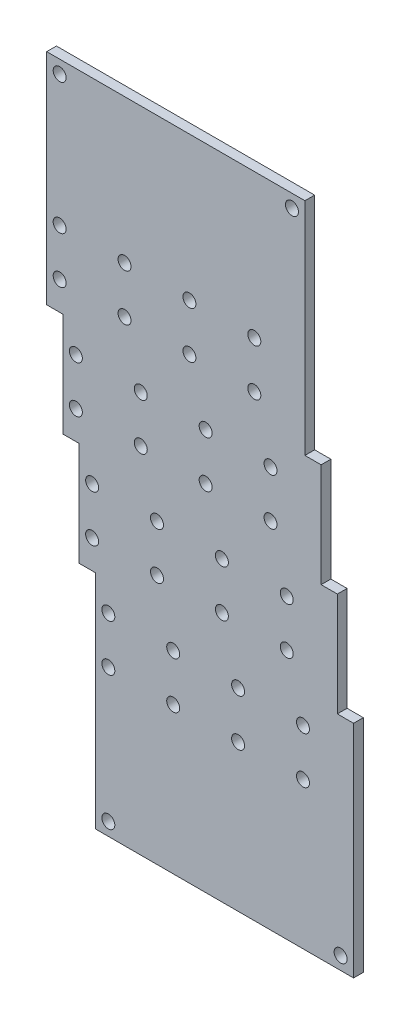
ISO-10303-21;
HEADER;
FILE_DESCRIPTION(('STEP AP214'),'2;1');
FILE_NAME('part.step','',(''),(''),'','','');
FILE_SCHEMA(('AUTOMOTIVE_DESIGN { 1 0 10303 214 1 1 1 1 }'));
ENDSEC;
DATA;
#1=APPLICATION_CONTEXT('core data for automotive mechanical design processes');
#2=APPLICATION_PROTOCOL_DEFINITION('international standard','automotive_design',2000,#1);
#3=PRODUCT_CONTEXT('',#1,'mechanical');
#4=PRODUCT('Part','Part','',(#3));
#5=PRODUCT_RELATED_PRODUCT_CATEGORY('part','',(#4));
#6=PRODUCT_DEFINITION_FORMATION('','',#4);
#7=PRODUCT_DEFINITION_CONTEXT('part definition',#1,'design');
#8=PRODUCT_DEFINITION('design','',#6,#7);
#9=PRODUCT_DEFINITION_SHAPE('','',#8);
#10=(LENGTH_UNIT() NAMED_UNIT(*) SI_UNIT(.MILLI.,.METRE.));
#11=(NAMED_UNIT(*) PLANE_ANGLE_UNIT() SI_UNIT($,.RADIAN.));
#12=(NAMED_UNIT(*) SI_UNIT($,.STERADIAN.) SOLID_ANGLE_UNIT());
#13=UNCERTAINTY_MEASURE_WITH_UNIT(LENGTH_MEASURE(1.E-05),#10,'distance_accuracy_value','');
#14=(GEOMETRIC_REPRESENTATION_CONTEXT(3) GLOBAL_UNCERTAINTY_ASSIGNED_CONTEXT((#13)) GLOBAL_UNIT_ASSIGNED_CONTEXT((#10,
#11,#12)) REPRESENTATION_CONTEXT('',''));
#15=CARTESIAN_POINT('',(0.,0.,0.));
#16=DIRECTION('',(0.,0.,1.));
#17=DIRECTION('',(1.,0.,0.));
#18=AXIS2_PLACEMENT_3D('',#15,#16,#17);
#19=CARTESIAN_POINT('',(0.,0.,1.5));
#20=DIRECTION('',(0.,-1.,0.));
#21=DIRECTION('',(0.,0.,-1.));
#22=AXIS2_PLACEMENT_3D('',#19,#20,#21);
#23=PLANE('',#22);
#24=DIRECTION('',(-1.,0.,0.));
#25=VECTOR('',#24,1.);
#26=CARTESIAN_POINT('',(0.,0.,0.));
#27=LINE('',#26,#25);
#28=CARTESIAN_POINT('',(39.8,0.,0.));
#29=VERTEX_POINT('',#28);
#30=CARTESIAN_POINT('',(0.,0.,0.));
#31=VERTEX_POINT('',#30);
#32=EDGE_CURVE('E179',#29,#31,#27,.T.);
#33=ORIENTED_EDGE('',*,*,#32,.T.);
#34=DIRECTION('',(0.,0.,-1.));
#35=VECTOR('',#34,1.);
#36=CARTESIAN_POINT('',(0.,0.,1.5));
#37=LINE('',#36,#35);
#38=CARTESIAN_POINT('',(0.,0.,1.5));
#39=VERTEX_POINT('',#38);
#40=EDGE_CURVE('E11',#39,#31,#37,.T.);
#41=ORIENTED_EDGE('',*,*,#40,.F.);
#42=DIRECTION('',(-1.,0.,0.));
#43=VECTOR('',#42,1.);
#44=CARTESIAN_POINT('',(0.,0.,1.5));
#45=LINE('',#44,#43);
#46=CARTESIAN_POINT('',(39.8,0.,1.5));
#47=VERTEX_POINT('',#46);
#48=EDGE_CURVE('E210',#47,#39,#45,.T.);
#49=ORIENTED_EDGE('',*,*,#48,.F.);
#50=DIRECTION('',(0.,0.,-1.));
#51=VECTOR('',#50,1.);
#52=CARTESIAN_POINT('',(39.8,0.,1.5));
#53=LINE('',#52,#51);
#54=EDGE_CURVE('E175',#47,#29,#53,.T.);
#55=ORIENTED_EDGE('',*,*,#54,.T.);
#56=EDGE_LOOP('',(#33,#41,#49,#55));
#57=FACE_BOUND('',#56,.T.);
#58=ADVANCED_FACE('F35',(#57),#23,.F.);
#59=CARTESIAN_POINT('',(0.,0.,1.5));
#60=DIRECTION('',(1.,0.,0.));
#61=DIRECTION('',(0.,1.,0.));
#62=AXIS2_PLACEMENT_3D('',#59,#60,#61);
#63=PLANE('',#62);
#64=DIRECTION('',(0.,-1.,0.));
#65=VECTOR('',#64,1.);
#66=CARTESIAN_POINT('',(0.,0.,0.));
#67=LINE('',#66,#65);
#68=CARTESIAN_POINT('',(0.,-33.8,0.));
#69=VERTEX_POINT('',#68);
#70=EDGE_CURVE('E182',#31,#69,#67,.T.);
#71=ORIENTED_EDGE('',*,*,#70,.T.);
#72=DIRECTION('',(0.,0.,-1.));
#73=VECTOR('',#72,1.);
#74=CARTESIAN_POINT('',(0.,-33.8,1.5));
#75=LINE('',#74,#73);
#76=CARTESIAN_POINT('',(0.,-33.8,1.5));
#77=VERTEX_POINT('',#76);
#78=EDGE_CURVE('E43',#77,#69,#75,.T.);
#79=ORIENTED_EDGE('',*,*,#78,.F.);
#80=DIRECTION('',(0.,-1.,0.));
#81=VECTOR('',#80,1.);
#82=CARTESIAN_POINT('',(0.,0.,1.5));
#83=LINE('',#82,#81);
#84=EDGE_CURVE('E118',#39,#77,#83,.T.);
#85=ORIENTED_EDGE('',*,*,#84,.F.);
#86=ORIENTED_EDGE('',*,*,#40,.T.);
#87=EDGE_LOOP('',(#71,#79,#85,#86));
#88=FACE_BOUND('',#87,.T.);
#89=ADVANCED_FACE('F309',(#88),#63,.F.);
#90=CARTESIAN_POINT('',(0.,-33.8,1.5));
#91=DIRECTION('',(0.,1.,0.));
#92=DIRECTION('',(0.,0.,1.));
#93=AXIS2_PLACEMENT_3D('',#90,#91,#92);
#94=PLANE('',#93);
#95=DIRECTION('',(1.,0.,0.));
#96=VECTOR('',#95,1.);
#97=CARTESIAN_POINT('',(0.,-33.8,0.));
#98=LINE('',#97,#96);
#99=CARTESIAN_POINT('',(2.5,-33.8,0.));
#100=VERTEX_POINT('',#99);
#101=EDGE_CURVE('E185',#69,#100,#98,.T.);
#102=ORIENTED_EDGE('',*,*,#101,.T.);
#103=DIRECTION('',(0.,0.,-1.));
#104=VECTOR('',#103,1.);
#105=CARTESIAN_POINT('',(2.5,-33.8,1.5));
#106=LINE('',#105,#104);
#107=CARTESIAN_POINT('',(2.5,-33.8,1.5));
#108=VERTEX_POINT('',#107);
#109=EDGE_CURVE('E241',#108,#100,#106,.T.);
#110=ORIENTED_EDGE('',*,*,#109,.F.);
#111=DIRECTION('',(1.,0.,0.));
#112=VECTOR('',#111,1.);
#113=CARTESIAN_POINT('',(0.,-33.8,1.5));
#114=LINE('',#113,#112);
#115=EDGE_CURVE('E249',#77,#108,#114,.T.);
#116=ORIENTED_EDGE('',*,*,#115,.F.);
#117=ORIENTED_EDGE('',*,*,#78,.T.);
#118=EDGE_LOOP('',(#102,#110,#116,#117));
#119=FACE_BOUND('',#118,.T.);
#120=ADVANCED_FACE('F247',(#119),#94,.F.);
#121=CARTESIAN_POINT('',(2.5,-33.8,1.5));
#122=DIRECTION('',(1.,0.,0.));
#123=DIRECTION('',(0.,1.,0.));
#124=AXIS2_PLACEMENT_3D('',#121,#122,#123);
#125=PLANE('',#124);
#126=DIRECTION('',(0.,-1.,0.));
#127=VECTOR('',#126,1.);
#128=CARTESIAN_POINT('',(2.5,-33.8,0.));
#129=LINE('',#128,#127);
#130=CARTESIAN_POINT('',(2.50000000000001,-49.8,0.));
#131=VERTEX_POINT('',#130);
#132=EDGE_CURVE('E187',#100,#131,#129,.T.);
#133=ORIENTED_EDGE('',*,*,#132,.T.);
#134=DIRECTION('',(0.,0.,-1.));
#135=VECTOR('',#134,1.);
#136=CARTESIAN_POINT('',(2.50000000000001,-49.8,1.5));
#137=LINE('',#136,#135);
#138=CARTESIAN_POINT('',(2.50000000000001,-49.8,1.5));
#139=VERTEX_POINT('',#138);
#140=EDGE_CURVE('E238',#139,#131,#137,.T.);
#141=ORIENTED_EDGE('',*,*,#140,.F.);
#142=DIRECTION('',(0.,-1.,0.));
#143=VECTOR('',#142,1.);
#144=CARTESIAN_POINT('',(2.5,-33.8,1.5));
#145=LINE('',#144,#143);
#146=EDGE_CURVE('E267',#108,#139,#145,.T.);
#147=ORIENTED_EDGE('',*,*,#146,.F.);
#148=ORIENTED_EDGE('',*,*,#109,.T.);
#149=EDGE_LOOP('',(#133,#141,#147,#148));
#150=FACE_BOUND('',#149,.T.);
#151=ADVANCED_FACE('F258',(#150),#125,.F.);
#152=CARTESIAN_POINT('',(2.50000000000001,-49.8,1.5));
#153=DIRECTION('',(0.,1.,0.));
#154=DIRECTION('',(0.,0.,1.));
#155=AXIS2_PLACEMENT_3D('',#152,#153,#154);
#156=PLANE('',#155);
#157=DIRECTION('',(1.,0.,0.));
#158=VECTOR('',#157,1.);
#159=CARTESIAN_POINT('',(2.50000000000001,-49.8,0.));
#160=LINE('',#159,#158);
#161=CARTESIAN_POINT('',(5.00000000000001,-49.8,0.));
#162=VERTEX_POINT('',#161);
#163=EDGE_CURVE('E189',#131,#162,#160,.T.);
#164=ORIENTED_EDGE('',*,*,#163,.T.);
#165=DIRECTION('',(0.,0.,-1.));
#166=VECTOR('',#165,1.);
#167=CARTESIAN_POINT('',(5.00000000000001,-49.8,1.5));
#168=LINE('',#167,#166);
#169=CARTESIAN_POINT('',(5.00000000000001,-49.8,1.5));
#170=VERTEX_POINT('',#169);
#171=EDGE_CURVE('E235',#170,#162,#168,.T.);
#172=ORIENTED_EDGE('',*,*,#171,.F.);
#173=DIRECTION('',(1.,0.,0.));
#174=VECTOR('',#173,1.);
#175=CARTESIAN_POINT('',(2.50000000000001,-49.8,1.5));
#176=LINE('',#175,#174);
#177=EDGE_CURVE('E264',#139,#170,#176,.T.);
#178=ORIENTED_EDGE('',*,*,#177,.F.);
#179=ORIENTED_EDGE('',*,*,#140,.T.);
#180=EDGE_LOOP('',(#164,#172,#178,#179));
#181=FACE_BOUND('',#180,.T.);
#182=ADVANCED_FACE('F262',(#181),#156,.F.);
#183=CARTESIAN_POINT('',(5.00000000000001,-49.8,1.5));
#184=DIRECTION('',(1.,0.,0.));
#185=DIRECTION('',(0.,1.,0.));
#186=AXIS2_PLACEMENT_3D('',#183,#184,#185);
#187=PLANE('',#186);
#188=DIRECTION('',(0.,-1.,0.));
#189=VECTOR('',#188,1.);
#190=CARTESIAN_POINT('',(5.00000000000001,-49.8,0.));
#191=LINE('',#190,#189);
#192=CARTESIAN_POINT('',(5.00000000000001,-65.8,0.));
#193=VERTEX_POINT('',#192);
#194=EDGE_CURVE('E191',#162,#193,#191,.T.);
#195=ORIENTED_EDGE('',*,*,#194,.T.);
#196=DIRECTION('',(0.,0.,-1.));
#197=VECTOR('',#196,1.);
#198=CARTESIAN_POINT('',(5.00000000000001,-65.8,1.5));
#199=LINE('',#198,#197);
#200=CARTESIAN_POINT('',(5.00000000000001,-65.8,1.5));
#201=VERTEX_POINT('',#200);
#202=EDGE_CURVE('E232',#201,#193,#199,.T.);
#203=ORIENTED_EDGE('',*,*,#202,.F.);
#204=DIRECTION('',(0.,-1.,0.));
#205=VECTOR('',#204,1.);
#206=CARTESIAN_POINT('',(5.00000000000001,-49.8,1.5));
#207=LINE('',#206,#205);
#208=EDGE_CURVE('E266',#170,#201,#207,.T.);
#209=ORIENTED_EDGE('',*,*,#208,.F.);
#210=ORIENTED_EDGE('',*,*,#171,.T.);
#211=EDGE_LOOP('',(#195,#203,#209,#210));
#212=FACE_BOUND('',#211,.T.);
#213=ADVANCED_FACE('F322',(#212),#187,.F.);
#214=CARTESIAN_POINT('',(5.00000000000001,-65.8,1.5));
#215=DIRECTION('',(0.,1.,0.));
#216=DIRECTION('',(0.,0.,1.));
#217=AXIS2_PLACEMENT_3D('',#214,#215,#216);
#218=PLANE('',#217);
#219=DIRECTION('',(1.,0.,0.));
#220=VECTOR('',#219,1.);
#221=CARTESIAN_POINT('',(5.00000000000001,-65.8,0.));
#222=LINE('',#221,#220);
#223=CARTESIAN_POINT('',(7.50000000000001,-65.8,0.));
#224=VERTEX_POINT('',#223);
#225=EDGE_CURVE('E193',#193,#224,#222,.T.);
#226=ORIENTED_EDGE('',*,*,#225,.T.);
#227=DIRECTION('',(0.,0.,-1.));
#228=VECTOR('',#227,1.);
#229=CARTESIAN_POINT('',(7.50000000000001,-65.8,1.5));
#230=LINE('',#229,#228);
#231=CARTESIAN_POINT('',(7.50000000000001,-65.8,1.5));
#232=VERTEX_POINT('',#231);
#233=EDGE_CURVE('E229',#232,#224,#230,.T.);
#234=ORIENTED_EDGE('',*,*,#233,.F.);
#235=DIRECTION('',(1.,0.,0.));
#236=VECTOR('',#235,1.);
#237=CARTESIAN_POINT('',(5.00000000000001,-65.8,1.5));
#238=LINE('',#237,#236);
#239=EDGE_CURVE('E269',#201,#232,#238,.T.);
#240=ORIENTED_EDGE('',*,*,#239,.F.);
#241=ORIENTED_EDGE('',*,*,#202,.T.);
#242=EDGE_LOOP('',(#226,#234,#240,#241));
#243=FACE_BOUND('',#242,.T.);
#244=ADVANCED_FACE('F325',(#243),#218,.F.);
#245=CARTESIAN_POINT('',(7.50000000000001,-65.8,1.5));
#246=DIRECTION('',(1.,0.,0.));
#247=DIRECTION('',(0.,1.,0.));
#248=AXIS2_PLACEMENT_3D('',#245,#246,#247);
#249=PLANE('',#248);
#250=DIRECTION('',(0.,-1.,0.));
#251=VECTOR('',#250,1.);
#252=CARTESIAN_POINT('',(7.50000000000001,-65.8,0.));
#253=LINE('',#252,#251);
#254=CARTESIAN_POINT('',(7.50000000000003,-100.,0.));
#255=VERTEX_POINT('',#254);
#256=EDGE_CURVE('E195',#224,#255,#253,.T.);
#257=ORIENTED_EDGE('',*,*,#256,.T.);
#258=DIRECTION('',(0.,0.,-1.));
#259=VECTOR('',#258,1.);
#260=CARTESIAN_POINT('',(7.50000000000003,-100.,1.5));
#261=LINE('',#260,#259);
#262=CARTESIAN_POINT('',(7.50000000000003,-100.,1.5));
#263=VERTEX_POINT('',#262);
#264=EDGE_CURVE('E226',#263,#255,#261,.T.);
#265=ORIENTED_EDGE('',*,*,#264,.F.);
#266=DIRECTION('',(0.,-1.,0.));
#267=VECTOR('',#266,1.);
#268=CARTESIAN_POINT('',(7.50000000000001,-65.8,1.5));
#269=LINE('',#268,#267);
#270=EDGE_CURVE('E275',#232,#263,#269,.T.);
#271=ORIENTED_EDGE('',*,*,#270,.F.);
#272=ORIENTED_EDGE('',*,*,#233,.T.);
#273=EDGE_LOOP('',(#257,#265,#271,#272));
#274=FACE_BOUND('',#273,.T.);
#275=ADVANCED_FACE('F329',(#274),#249,.F.);
#276=CARTESIAN_POINT('',(47.3,-100.,1.5));
#277=DIRECTION('',(0.,1.,0.));
#278=DIRECTION('',(0.,0.,1.));
#279=AXIS2_PLACEMENT_3D('',#276,#277,#278);
#280=PLANE('',#279);
#281=DIRECTION('',(1.,0.,0.));
#282=VECTOR('',#281,1.);
#283=CARTESIAN_POINT('',(47.3,-100.,0.));
#284=LINE('',#283,#282);
#285=CARTESIAN_POINT('',(47.3,-100.,0.));
#286=VERTEX_POINT('',#285);
#287=EDGE_CURVE('E197',#255,#286,#284,.T.);
#288=ORIENTED_EDGE('',*,*,#287,.T.);
#289=DIRECTION('',(0.,0.,-1.));
#290=VECTOR('',#289,1.);
#291=CARTESIAN_POINT('',(47.3,-100.,1.5));
#292=LINE('',#291,#290);
#293=CARTESIAN_POINT('',(47.3,-100.,1.5));
#294=VERTEX_POINT('',#293);
#295=EDGE_CURVE('E223',#294,#286,#292,.T.);
#296=ORIENTED_EDGE('',*,*,#295,.F.);
#297=DIRECTION('',(1.,0.,0.));
#298=VECTOR('',#297,1.);
#299=CARTESIAN_POINT('',(47.3,-100.,1.5));
#300=LINE('',#299,#298);
#301=EDGE_CURVE('E277',#263,#294,#300,.T.);
#302=ORIENTED_EDGE('',*,*,#301,.F.);
#303=ORIENTED_EDGE('',*,*,#264,.T.);
#304=EDGE_LOOP('',(#288,#296,#302,#303));
#305=FACE_BOUND('',#304,.T.);
#306=ADVANCED_FACE('F333',(#305),#280,.F.);
#307=CARTESIAN_POINT('',(47.3,-66.,1.5));
#308=DIRECTION('',(-1.,0.,0.));
#309=DIRECTION('',(0.,-1.,0.));
#310=AXIS2_PLACEMENT_3D('',#307,#308,#309);
#311=PLANE('',#310);
#312=DIRECTION('',(0.,1.,0.));
#313=VECTOR('',#312,1.);
#314=CARTESIAN_POINT('',(47.3,-66.,0.));
#315=LINE('',#314,#313);
#316=CARTESIAN_POINT('',(47.3,-66.,0.));
#317=VERTEX_POINT('',#316);
#318=EDGE_CURVE('E199',#286,#317,#315,.T.);
#319=ORIENTED_EDGE('',*,*,#318,.T.);
#320=DIRECTION('',(0.,0.,-1.));
#321=VECTOR('',#320,1.);
#322=CARTESIAN_POINT('',(47.3,-66.,1.5));
#323=LINE('',#322,#321);
#324=CARTESIAN_POINT('',(47.3,-66.,1.5));
#325=VERTEX_POINT('',#324);
#326=EDGE_CURVE('E220',#325,#317,#323,.T.);
#327=ORIENTED_EDGE('',*,*,#326,.F.);
#328=DIRECTION('',(0.,1.,0.));
#329=VECTOR('',#328,1.);
#330=CARTESIAN_POINT('',(47.3,-66.,1.5));
#331=LINE('',#330,#329);
#332=EDGE_CURVE('E279',#294,#325,#331,.T.);
#333=ORIENTED_EDGE('',*,*,#332,.F.);
#334=ORIENTED_EDGE('',*,*,#295,.T.);
#335=EDGE_LOOP('',(#319,#327,#333,#334));
#336=FACE_BOUND('',#335,.T.);
#337=ADVANCED_FACE('F337',(#336),#311,.F.);
#338=CARTESIAN_POINT('',(44.8,-66.,1.5));
#339=DIRECTION('',(0.,-1.,0.));
#340=DIRECTION('',(1.,0.,0.));
#341=AXIS2_PLACEMENT_3D('',#338,#339,#340);
#342=PLANE('',#341);
#343=DIRECTION('',(-1.,0.,0.));
#344=VECTOR('',#343,1.);
#345=CARTESIAN_POINT('',(44.8,-66.,0.));
#346=LINE('',#345,#344);
#347=CARTESIAN_POINT('',(44.8,-66.,0.));
#348=VERTEX_POINT('',#347);
#349=EDGE_CURVE('E201',#317,#348,#346,.T.);
#350=ORIENTED_EDGE('',*,*,#349,.T.);
#351=DIRECTION('',(0.,0.,-1.));
#352=VECTOR('',#351,1.);
#353=CARTESIAN_POINT('',(44.8,-66.,1.5));
#354=LINE('',#353,#352);
#355=CARTESIAN_POINT('',(44.8,-66.,1.5));
#356=VERTEX_POINT('',#355);
#357=EDGE_CURVE('E217',#356,#348,#354,.T.);
#358=ORIENTED_EDGE('',*,*,#357,.F.);
#359=DIRECTION('',(-1.,0.,0.));
#360=VECTOR('',#359,1.);
#361=CARTESIAN_POINT('',(44.8,-66.,1.5));
#362=LINE('',#361,#360);
#363=EDGE_CURVE('E281',#325,#356,#362,.T.);
#364=ORIENTED_EDGE('',*,*,#363,.F.);
#365=ORIENTED_EDGE('',*,*,#326,.T.);
#366=EDGE_LOOP('',(#350,#358,#364,#365));
#367=FACE_BOUND('',#366,.T.);
#368=ADVANCED_FACE('F341',(#367),#342,.F.);
#369=CARTESIAN_POINT('',(44.8,-50.,1.5));
#370=DIRECTION('',(-1.,0.,0.));
#371=DIRECTION('',(0.,0.,1.));
#372=AXIS2_PLACEMENT_3D('',#369,#370,#371);
#373=PLANE('',#372);
#374=DIRECTION('',(0.,1.,0.));
#375=VECTOR('',#374,1.);
#376=CARTESIAN_POINT('',(44.8,-50.,0.));
#377=LINE('',#376,#375);
#378=CARTESIAN_POINT('',(44.8,-50.,0.));
#379=VERTEX_POINT('',#378);
#380=EDGE_CURVE('E203',#348,#379,#377,.T.);
#381=ORIENTED_EDGE('',*,*,#380,.T.);
#382=DIRECTION('',(0.,0.,-1.));
#383=VECTOR('',#382,1.);
#384=CARTESIAN_POINT('',(44.8,-50.,1.5));
#385=LINE('',#384,#383);
#386=CARTESIAN_POINT('',(44.8,-50.,1.5));
#387=VERTEX_POINT('',#386);
#388=EDGE_CURVE('E214',#387,#379,#385,.T.);
#389=ORIENTED_EDGE('',*,*,#388,.F.);
#390=DIRECTION('',(0.,1.,0.));
#391=VECTOR('',#390,1.);
#392=CARTESIAN_POINT('',(44.8,-50.,1.5));
#393=LINE('',#392,#391);
#394=EDGE_CURVE('E283',#356,#387,#393,.T.);
#395=ORIENTED_EDGE('',*,*,#394,.F.);
#396=ORIENTED_EDGE('',*,*,#357,.T.);
#397=EDGE_LOOP('',(#381,#389,#395,#396));
#398=FACE_BOUND('',#397,.T.);
#399=ADVANCED_FACE('F289',(#398),#373,.F.);
#400=CARTESIAN_POINT('',(42.3,-50.,1.5));
#401=DIRECTION('',(0.,-1.,0.));
#402=DIRECTION('',(0.,0.,-1.));
#403=AXIS2_PLACEMENT_3D('',#400,#401,#402);
#404=PLANE('',#403);
#405=DIRECTION('',(-1.,0.,0.));
#406=VECTOR('',#405,1.);
#407=CARTESIAN_POINT('',(42.3,-50.,0.));
#408=LINE('',#407,#406);
#409=CARTESIAN_POINT('',(42.3,-50.,0.));
#410=VERTEX_POINT('',#409);
#411=EDGE_CURVE('E205',#379,#410,#408,.T.);
#412=ORIENTED_EDGE('',*,*,#411,.T.);
#413=DIRECTION('',(0.,0.,-1.));
#414=VECTOR('',#413,1.);
#415=CARTESIAN_POINT('',(42.3,-50.,1.5));
#416=LINE('',#415,#414);
#417=CARTESIAN_POINT('',(42.3,-50.,1.5));
#418=VERTEX_POINT('',#417);
#419=EDGE_CURVE('E170',#418,#410,#416,.T.);
#420=ORIENTED_EDGE('',*,*,#419,.F.);
#421=DIRECTION('',(-1.,0.,0.));
#422=VECTOR('',#421,1.);
#423=CARTESIAN_POINT('',(42.3,-50.,1.5));
#424=LINE('',#423,#422);
#425=EDGE_CURVE('E161',#387,#418,#424,.T.);
#426=ORIENTED_EDGE('',*,*,#425,.F.);
#427=ORIENTED_EDGE('',*,*,#388,.T.);
#428=EDGE_LOOP('',(#412,#420,#426,#427));
#429=FACE_BOUND('',#428,.T.);
#430=ADVANCED_FACE('F293',(#429),#404,.F.);
#431=CARTESIAN_POINT('',(42.3,-34.,1.5));
#432=DIRECTION('',(-1.,0.,0.));
#433=DIRECTION('',(0.,-1.,0.));
#434=AXIS2_PLACEMENT_3D('',#431,#432,#433);
#435=PLANE('',#434);
#436=DIRECTION('',(0.,1.,0.));
#437=VECTOR('',#436,1.);
#438=CARTESIAN_POINT('',(42.3,-34.,0.));
#439=LINE('',#438,#437);
#440=CARTESIAN_POINT('',(42.3,-34.,0.));
#441=VERTEX_POINT('',#440);
#442=EDGE_CURVE('E169',#410,#441,#439,.T.);
#443=ORIENTED_EDGE('',*,*,#442,.T.);
#444=DIRECTION('',(0.,0.,-1.));
#445=VECTOR('',#444,1.);
#446=CARTESIAN_POINT('',(42.3,-34.,1.5));
#447=LINE('',#446,#445);
#448=CARTESIAN_POINT('',(42.3,-34.,1.5));
#449=VERTEX_POINT('',#448);
#450=EDGE_CURVE('E166',#449,#441,#447,.T.);
#451=ORIENTED_EDGE('',*,*,#450,.F.);
#452=DIRECTION('',(0.,1.,0.));
#453=VECTOR('',#452,1.);
#454=CARTESIAN_POINT('',(42.3,-34.,1.5));
#455=LINE('',#454,#453);
#456=EDGE_CURVE('E155',#418,#449,#455,.T.);
#457=ORIENTED_EDGE('',*,*,#456,.F.);
#458=ORIENTED_EDGE('',*,*,#419,.T.);
#459=EDGE_LOOP('',(#443,#451,#457,#458));
#460=FACE_BOUND('',#459,.T.);
#461=ADVANCED_FACE('F167',(#460),#435,.F.);
#462=CARTESIAN_POINT('',(39.8,-34.,1.5));
#463=DIRECTION('',(0.,-1.,0.));
#464=DIRECTION('',(0.,0.,-1.));
#465=AXIS2_PLACEMENT_3D('',#462,#463,#464);
#466=PLANE('',#465);
#467=DIRECTION('',(-1.,0.,0.));
#468=VECTOR('',#467,1.);
#469=CARTESIAN_POINT('',(39.8,-34.,0.));
#470=LINE('',#469,#468);
#471=CARTESIAN_POINT('',(39.8,-34.,0.));
#472=VERTEX_POINT('',#471);
#473=EDGE_CURVE('E104',#441,#472,#470,.T.);
#474=ORIENTED_EDGE('',*,*,#473,.T.);
#475=DIRECTION('',(0.,0.,-1.));
#476=VECTOR('',#475,1.);
#477=CARTESIAN_POINT('',(39.8,-34.,1.5));
#478=LINE('',#477,#476);
#479=CARTESIAN_POINT('',(39.8,-34.,1.5));
#480=VERTEX_POINT('',#479);
#481=EDGE_CURVE('E171',#480,#472,#478,.T.);
#482=ORIENTED_EDGE('',*,*,#481,.F.);
#483=DIRECTION('',(-1.,0.,0.));
#484=VECTOR('',#483,1.);
#485=CARTESIAN_POINT('',(39.8,-34.,1.5));
#486=LINE('',#485,#484);
#487=EDGE_CURVE('E159',#449,#480,#486,.T.);
#488=ORIENTED_EDGE('',*,*,#487,.F.);
#489=ORIENTED_EDGE('',*,*,#450,.T.);
#490=EDGE_LOOP('',(#474,#482,#488,#489));
#491=FACE_BOUND('',#490,.T.);
#492=ADVANCED_FACE('F173',(#491),#466,.F.);
#493=CARTESIAN_POINT('',(39.8,0.,1.5));
#494=DIRECTION('',(-1.,0.,0.));
#495=DIRECTION('',(0.,-1.,0.));
#496=AXIS2_PLACEMENT_3D('',#493,#494,#495);
#497=PLANE('',#496);
#498=DIRECTION('',(0.,1.,0.));
#499=VECTOR('',#498,1.);
#500=CARTESIAN_POINT('',(39.8,0.,0.));
#501=LINE('',#500,#499);
#502=EDGE_CURVE('E110',#472,#29,#501,.T.);
#503=ORIENTED_EDGE('',*,*,#502,.T.);
#504=ORIENTED_EDGE('',*,*,#54,.F.);
#505=DIRECTION('',(0.,1.,0.));
#506=VECTOR('',#505,1.);
#507=CARTESIAN_POINT('',(39.8,0.,1.5));
#508=LINE('',#507,#506);
#509=EDGE_CURVE('E51',#480,#47,#508,.T.);
#510=ORIENTED_EDGE('',*,*,#509,.F.);
#511=ORIENTED_EDGE('',*,*,#481,.T.);
#512=EDGE_LOOP('',(#503,#504,#510,#511));
#513=FACE_BOUND('',#512,.T.);
#514=ADVANCED_FACE('F297',(#513),#497,.F.);
#515=CARTESIAN_POINT('',(0.,0.,1.5));
#516=DIRECTION('',(0.,0.,-1.));
#517=DIRECTION('',(-1.,0.,0.));
#518=AXIS2_PLACEMENT_3D('',#515,#516,#517);
#519=PLANE('',#518);
#520=CARTESIAN_POINT('',(37.8,-2.,1.5));
#521=DIRECTION('',(0.,0.,1.));
#522=DIRECTION('',(1.,0.,0.));
#523=AXIS2_PLACEMENT_3D('',#520,#521,#522);
#524=CIRCLE('',#523,0.999999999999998);
#525=CARTESIAN_POINT('',(38.8,-2.,1.5));
#526=VERTEX_POINT('',#525);
#527=EDGE_CURVE('E747',#526,#526,#524,.T.);
#528=ORIENTED_EDGE('',*,*,#527,.F.);
#529=EDGE_LOOP('',(#528));
#530=FACE_BOUND('',#529,.T.);
#531=CARTESIAN_POINT('',(9.50000000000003,-98.,1.5));
#532=DIRECTION('',(0.,0.,1.));
#533=DIRECTION('',(1.,0.,0.));
#534=AXIS2_PLACEMENT_3D('',#531,#532,#533);
#535=CIRCLE('',#534,1.);
#536=CARTESIAN_POINT('',(10.5,-98.,1.5));
#537=VERTEX_POINT('',#536);
#538=EDGE_CURVE('E753',#537,#537,#535,.T.);
#539=ORIENTED_EDGE('',*,*,#538,.F.);
#540=EDGE_LOOP('',(#539));
#541=FACE_BOUND('',#540,.T.);
#542=CARTESIAN_POINT('',(45.3,-98.,1.5));
#543=DIRECTION('',(0.,0.,1.));
#544=DIRECTION('',(1.,0.,0.));
#545=AXIS2_PLACEMENT_3D('',#542,#543,#544);
#546=CIRCLE('',#545,0.999999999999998);
#547=CARTESIAN_POINT('',(46.3,-98.,1.5));
#548=VERTEX_POINT('',#547);
#549=EDGE_CURVE('E761',#548,#548,#546,.T.);
#550=ORIENTED_EDGE('',*,*,#549,.F.);
#551=EDGE_LOOP('',(#550));
#552=FACE_BOUND('',#551,.T.);
#553=CARTESIAN_POINT('',(2.,-2.,1.5));
#554=DIRECTION('',(0.,0.,1.));
#555=DIRECTION('',(1.,0.,0.));
#556=AXIS2_PLACEMENT_3D('',#553,#554,#555);
#557=CIRCLE('',#556,1.);
#558=CARTESIAN_POINT('',(3.,-2.,1.5));
#559=VERTEX_POINT('',#558);
#560=EDGE_CURVE('E751',#559,#559,#557,.T.);
#561=ORIENTED_EDGE('',*,*,#560,.F.);
#562=EDGE_LOOP('',(#561));
#563=FACE_BOUND('',#562,.T.);
#564=CARTESIAN_POINT('',(2.,-29.4,1.5));
#565=DIRECTION('',(0.,0.,1.));
#566=DIRECTION('',(1.,0.,0.));
#567=AXIS2_PLACEMENT_3D('',#564,#565,#566);
#568=CIRCLE('',#567,1.);
#569=CARTESIAN_POINT('',(3.,-29.4,1.5));
#570=VERTEX_POINT('',#569);
#571=EDGE_CURVE('E770',#570,#570,#568,.T.);
#572=ORIENTED_EDGE('',*,*,#571,.F.);
#573=EDGE_LOOP('',(#572));
#574=FACE_BOUND('',#573,.T.);
#575=CARTESIAN_POINT('',(4.5,-38.2,1.5));
#576=DIRECTION('',(0.,0.,1.));
#577=DIRECTION('',(1.,0.,0.));
#578=AXIS2_PLACEMENT_3D('',#575,#576,#577);
#579=CIRCLE('',#578,1.);
#580=CARTESIAN_POINT('',(5.5,-38.2,1.5));
#581=VERTEX_POINT('',#580);
#582=EDGE_CURVE('E777',#581,#581,#579,.T.);
#583=ORIENTED_EDGE('',*,*,#582,.F.);
#584=EDGE_LOOP('',(#583));
#585=FACE_BOUND('',#584,.T.);
#586=CARTESIAN_POINT('',(4.5,-45.4,1.5));
#587=DIRECTION('',(0.,0.,1.));
#588=DIRECTION('',(1.,0.,0.));
#589=AXIS2_PLACEMENT_3D('',#586,#587,#588);
#590=CIRCLE('',#589,1.);
#591=CARTESIAN_POINT('',(5.5,-45.4,1.5));
#592=VERTEX_POINT('',#591);
#593=EDGE_CURVE('E783',#592,#592,#590,.T.);
#594=ORIENTED_EDGE('',*,*,#593,.F.);
#595=EDGE_LOOP('',(#594));
#596=FACE_BOUND('',#595,.T.);
#597=CARTESIAN_POINT('',(7.00000000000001,-54.2,1.5));
#598=DIRECTION('',(0.,0.,1.));
#599=DIRECTION('',(1.,0.,0.));
#600=AXIS2_PLACEMENT_3D('',#597,#598,#599);
#601=CIRCLE('',#600,1.);
#602=CARTESIAN_POINT('',(8.00000000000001,-54.2,1.5));
#603=VERTEX_POINT('',#602);
#604=EDGE_CURVE('E789',#603,#603,#601,.T.);
#605=ORIENTED_EDGE('',*,*,#604,.F.);
#606=EDGE_LOOP('',(#605));
#607=FACE_BOUND('',#606,.T.);
#608=CARTESIAN_POINT('',(7.00000000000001,-61.4,1.5));
#609=DIRECTION('',(0.,0.,1.));
#610=DIRECTION('',(1.,0.,0.));
#611=AXIS2_PLACEMENT_3D('',#608,#609,#610);
#612=CIRCLE('',#611,1.);
#613=CARTESIAN_POINT('',(8.00000000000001,-61.4,1.5));
#614=VERTEX_POINT('',#613);
#615=EDGE_CURVE('E795',#614,#614,#612,.T.);
#616=ORIENTED_EDGE('',*,*,#615,.F.);
#617=EDGE_LOOP('',(#616));
#618=FACE_BOUND('',#617,.T.);
#619=CARTESIAN_POINT('',(9.50000000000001,-70.2,1.5));
#620=DIRECTION('',(0.,0.,1.));
#621=DIRECTION('',(1.,0.,0.));
#622=AXIS2_PLACEMENT_3D('',#619,#620,#621);
#623=CIRCLE('',#622,1.);
#624=CARTESIAN_POINT('',(10.5,-70.2,1.5));
#625=VERTEX_POINT('',#624);
#626=EDGE_CURVE('E801',#625,#625,#623,.T.);
#627=ORIENTED_EDGE('',*,*,#626,.F.);
#628=EDGE_LOOP('',(#627));
#629=FACE_BOUND('',#628,.T.);
#630=CARTESIAN_POINT('',(9.50000000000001,-77.4,1.5));
#631=DIRECTION('',(0.,0.,1.));
#632=DIRECTION('',(1.,0.,0.));
#633=AXIS2_PLACEMENT_3D('',#630,#631,#632);
#634=CIRCLE('',#633,1.);
#635=CARTESIAN_POINT('',(10.5,-77.4,1.5));
#636=VERTEX_POINT('',#635);
#637=EDGE_CURVE('E807',#636,#636,#634,.T.);
#638=ORIENTED_EDGE('',*,*,#637,.F.);
#639=EDGE_LOOP('',(#638));
#640=FACE_BOUND('',#639,.T.);
#641=CARTESIAN_POINT('',(12.,-22.2,1.5));
#642=DIRECTION('',(0.,0.,1.));
#643=DIRECTION('',(1.,0.,0.));
#644=AXIS2_PLACEMENT_3D('',#641,#642,#643);
#645=CIRCLE('',#644,1.);
#646=CARTESIAN_POINT('',(13.,-22.2,1.5));
#647=VERTEX_POINT('',#646);
#648=EDGE_CURVE('E813',#647,#647,#645,.T.);
#649=ORIENTED_EDGE('',*,*,#648,.F.);
#650=EDGE_LOOP('',(#649));
#651=FACE_BOUND('',#650,.T.);
#652=CARTESIAN_POINT('',(12.,-29.4,1.5));
#653=DIRECTION('',(0.,0.,1.));
#654=DIRECTION('',(1.,0.,0.));
#655=AXIS2_PLACEMENT_3D('',#652,#653,#654);
#656=CIRCLE('',#655,1.);
#657=CARTESIAN_POINT('',(13.,-29.4,1.5));
#658=VERTEX_POINT('',#657);
#659=EDGE_CURVE('E819',#658,#658,#656,.T.);
#660=ORIENTED_EDGE('',*,*,#659,.F.);
#661=EDGE_LOOP('',(#660));
#662=FACE_BOUND('',#661,.T.);
#663=CARTESIAN_POINT('',(14.5,-38.2,1.5));
#664=DIRECTION('',(0.,0.,1.));
#665=DIRECTION('',(1.,0.,0.));
#666=AXIS2_PLACEMENT_3D('',#663,#664,#665);
#667=CIRCLE('',#666,1.);
#668=CARTESIAN_POINT('',(15.5,-38.2,1.5));
#669=VERTEX_POINT('',#668);
#670=EDGE_CURVE('E825',#669,#669,#667,.T.);
#671=ORIENTED_EDGE('',*,*,#670,.F.);
#672=EDGE_LOOP('',(#671));
#673=FACE_BOUND('',#672,.T.);
#674=CARTESIAN_POINT('',(14.5,-45.4,1.5));
#675=DIRECTION('',(0.,0.,1.));
#676=DIRECTION('',(1.,0.,0.));
#677=AXIS2_PLACEMENT_3D('',#674,#675,#676);
#678=CIRCLE('',#677,1.);
#679=CARTESIAN_POINT('',(15.5,-45.4,1.5));
#680=VERTEX_POINT('',#679);
#681=EDGE_CURVE('E831',#680,#680,#678,.T.);
#682=ORIENTED_EDGE('',*,*,#681,.F.);
#683=EDGE_LOOP('',(#682));
#684=FACE_BOUND('',#683,.T.);
#685=CARTESIAN_POINT('',(17.,-54.2,1.5));
#686=DIRECTION('',(0.,0.,1.));
#687=DIRECTION('',(1.,0.,0.));
#688=AXIS2_PLACEMENT_3D('',#685,#686,#687);
#689=CIRCLE('',#688,1.);
#690=CARTESIAN_POINT('',(18.,-54.2,1.5));
#691=VERTEX_POINT('',#690);
#692=EDGE_CURVE('E837',#691,#691,#689,.T.);
#693=ORIENTED_EDGE('',*,*,#692,.F.);
#694=EDGE_LOOP('',(#693));
#695=FACE_BOUND('',#694,.T.);
#696=CARTESIAN_POINT('',(17.,-61.4,1.5));
#697=DIRECTION('',(0.,0.,1.));
#698=DIRECTION('',(1.,0.,0.));
#699=AXIS2_PLACEMENT_3D('',#696,#697,#698);
#700=CIRCLE('',#699,1.);
#701=CARTESIAN_POINT('',(18.,-61.4,1.5));
#702=VERTEX_POINT('',#701);
#703=EDGE_CURVE('E843',#702,#702,#700,.T.);
#704=ORIENTED_EDGE('',*,*,#703,.F.);
#705=EDGE_LOOP('',(#704));
#706=FACE_BOUND('',#705,.T.);
#707=CARTESIAN_POINT('',(19.5,-70.2,1.5));
#708=DIRECTION('',(0.,0.,1.));
#709=DIRECTION('',(1.,0.,0.));
#710=AXIS2_PLACEMENT_3D('',#707,#708,#709);
#711=CIRCLE('',#710,1.);
#712=CARTESIAN_POINT('',(20.5,-70.2,1.5));
#713=VERTEX_POINT('',#712);
#714=EDGE_CURVE('E849',#713,#713,#711,.T.);
#715=ORIENTED_EDGE('',*,*,#714,.F.);
#716=EDGE_LOOP('',(#715));
#717=FACE_BOUND('',#716,.T.);
#718=CARTESIAN_POINT('',(19.5,-77.4,1.5));
#719=DIRECTION('',(0.,0.,1.));
#720=DIRECTION('',(1.,0.,0.));
#721=AXIS2_PLACEMENT_3D('',#718,#719,#720);
#722=CIRCLE('',#721,1.);
#723=CARTESIAN_POINT('',(20.5,-77.4,1.5));
#724=VERTEX_POINT('',#723);
#725=EDGE_CURVE('E855',#724,#724,#722,.T.);
#726=ORIENTED_EDGE('',*,*,#725,.F.);
#727=EDGE_LOOP('',(#726));
#728=FACE_BOUND('',#727,.T.);
#729=CARTESIAN_POINT('',(22.,-22.2,1.5));
#730=DIRECTION('',(0.,0.,1.));
#731=DIRECTION('',(1.,0.,0.));
#732=AXIS2_PLACEMENT_3D('',#729,#730,#731);
#733=CIRCLE('',#732,1.);
#734=CARTESIAN_POINT('',(23.,-22.2,1.5));
#735=VERTEX_POINT('',#734);
#736=EDGE_CURVE('E861',#735,#735,#733,.T.);
#737=ORIENTED_EDGE('',*,*,#736,.F.);
#738=EDGE_LOOP('',(#737));
#739=FACE_BOUND('',#738,.T.);
#740=CARTESIAN_POINT('',(22.,-29.4,1.5));
#741=DIRECTION('',(0.,0.,1.));
#742=DIRECTION('',(1.,0.,0.));
#743=AXIS2_PLACEMENT_3D('',#740,#741,#742);
#744=CIRCLE('',#743,1.);
#745=CARTESIAN_POINT('',(23.,-29.4,1.5));
#746=VERTEX_POINT('',#745);
#747=EDGE_CURVE('E867',#746,#746,#744,.T.);
#748=ORIENTED_EDGE('',*,*,#747,.F.);
#749=EDGE_LOOP('',(#748));
#750=FACE_BOUND('',#749,.T.);
#751=CARTESIAN_POINT('',(24.5,-38.2,1.5));
#752=DIRECTION('',(0.,0.,1.));
#753=DIRECTION('',(1.,0.,0.));
#754=AXIS2_PLACEMENT_3D('',#751,#752,#753);
#755=CIRCLE('',#754,1.);
#756=CARTESIAN_POINT('',(25.5,-38.2,1.5));
#757=VERTEX_POINT('',#756);
#758=EDGE_CURVE('E873',#757,#757,#755,.T.);
#759=ORIENTED_EDGE('',*,*,#758,.F.);
#760=EDGE_LOOP('',(#759));
#761=FACE_BOUND('',#760,.T.);
#762=CARTESIAN_POINT('',(24.5,-45.4,1.5));
#763=DIRECTION('',(0.,0.,1.));
#764=DIRECTION('',(1.,0.,0.));
#765=AXIS2_PLACEMENT_3D('',#762,#763,#764);
#766=CIRCLE('',#765,1.);
#767=CARTESIAN_POINT('',(25.5,-45.4,1.5));
#768=VERTEX_POINT('',#767);
#769=EDGE_CURVE('E879',#768,#768,#766,.T.);
#770=ORIENTED_EDGE('',*,*,#769,.F.);
#771=EDGE_LOOP('',(#770));
#772=FACE_BOUND('',#771,.T.);
#773=CARTESIAN_POINT('',(27.,-54.2,1.5));
#774=DIRECTION('',(0.,0.,1.));
#775=DIRECTION('',(1.,0.,0.));
#776=AXIS2_PLACEMENT_3D('',#773,#774,#775);
#777=CIRCLE('',#776,1.00000000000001);
#778=CARTESIAN_POINT('',(28.,-54.2,1.5));
#779=VERTEX_POINT('',#778);
#780=EDGE_CURVE('E885',#779,#779,#777,.T.);
#781=ORIENTED_EDGE('',*,*,#780,.F.);
#782=EDGE_LOOP('',(#781));
#783=FACE_BOUND('',#782,.T.);
#784=CARTESIAN_POINT('',(27.,-61.4,1.5));
#785=DIRECTION('',(0.,0.,1.));
#786=DIRECTION('',(1.,0.,0.));
#787=AXIS2_PLACEMENT_3D('',#784,#785,#786);
#788=CIRCLE('',#787,1.);
#789=CARTESIAN_POINT('',(28.,-61.4,1.5));
#790=VERTEX_POINT('',#789);
#791=EDGE_CURVE('E891',#790,#790,#788,.T.);
#792=ORIENTED_EDGE('',*,*,#791,.F.);
#793=EDGE_LOOP('',(#792));
#794=FACE_BOUND('',#793,.T.);
#795=CARTESIAN_POINT('',(29.5,-70.2,1.5));
#796=DIRECTION('',(0.,0.,1.));
#797=DIRECTION('',(1.,0.,0.));
#798=AXIS2_PLACEMENT_3D('',#795,#796,#797);
#799=CIRCLE('',#798,1.00000000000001);
#800=CARTESIAN_POINT('',(30.5,-70.2,1.5));
#801=VERTEX_POINT('',#800);
#802=EDGE_CURVE('E897',#801,#801,#799,.T.);
#803=ORIENTED_EDGE('',*,*,#802,.F.);
#804=EDGE_LOOP('',(#803));
#805=FACE_BOUND('',#804,.T.);
#806=CARTESIAN_POINT('',(29.5,-77.4,1.5));
#807=DIRECTION('',(0.,0.,1.));
#808=DIRECTION('',(1.,0.,0.));
#809=AXIS2_PLACEMENT_3D('',#806,#807,#808);
#810=CIRCLE('',#809,1.00000000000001);
#811=CARTESIAN_POINT('',(30.5,-77.4,1.5));
#812=VERTEX_POINT('',#811);
#813=EDGE_CURVE('E903',#812,#812,#810,.T.);
#814=ORIENTED_EDGE('',*,*,#813,.F.);
#815=EDGE_LOOP('',(#814));
#816=FACE_BOUND('',#815,.T.);
#817=CARTESIAN_POINT('',(32.,-22.2,1.5));
#818=DIRECTION('',(0.,0.,1.));
#819=DIRECTION('',(1.,0.,0.));
#820=AXIS2_PLACEMENT_3D('',#817,#818,#819);
#821=CIRCLE('',#820,0.999999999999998);
#822=CARTESIAN_POINT('',(33.,-22.2,1.5));
#823=VERTEX_POINT('',#822);
#824=EDGE_CURVE('E909',#823,#823,#821,.T.);
#825=ORIENTED_EDGE('',*,*,#824,.F.);
#826=EDGE_LOOP('',(#825));
#827=FACE_BOUND('',#826,.T.);
#828=CARTESIAN_POINT('',(32.,-29.4,1.5));
#829=DIRECTION('',(0.,0.,1.));
#830=DIRECTION('',(1.,0.,0.));
#831=AXIS2_PLACEMENT_3D('',#828,#829,#830);
#832=CIRCLE('',#831,0.999999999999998);
#833=CARTESIAN_POINT('',(33.,-29.4,1.5));
#834=VERTEX_POINT('',#833);
#835=EDGE_CURVE('E915',#834,#834,#832,.T.);
#836=ORIENTED_EDGE('',*,*,#835,.F.);
#837=EDGE_LOOP('',(#836));
#838=FACE_BOUND('',#837,.T.);
#839=CARTESIAN_POINT('',(34.5,-38.2,1.5));
#840=DIRECTION('',(0.,0.,1.));
#841=DIRECTION('',(1.,0.,0.));
#842=AXIS2_PLACEMENT_3D('',#839,#840,#841);
#843=CIRCLE('',#842,0.999999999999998);
#844=CARTESIAN_POINT('',(35.5,-38.2,1.5));
#845=VERTEX_POINT('',#844);
#846=EDGE_CURVE('E921',#845,#845,#843,.T.);
#847=ORIENTED_EDGE('',*,*,#846,.F.);
#848=EDGE_LOOP('',(#847));
#849=FACE_BOUND('',#848,.T.);
#850=CARTESIAN_POINT('',(34.5,-45.4,1.5));
#851=DIRECTION('',(0.,0.,1.));
#852=DIRECTION('',(1.,0.,0.));
#853=AXIS2_PLACEMENT_3D('',#850,#851,#852);
#854=CIRCLE('',#853,0.999999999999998);
#855=CARTESIAN_POINT('',(35.5,-45.4,1.5));
#856=VERTEX_POINT('',#855);
#857=EDGE_CURVE('E927',#856,#856,#854,.T.);
#858=ORIENTED_EDGE('',*,*,#857,.F.);
#859=EDGE_LOOP('',(#858));
#860=FACE_BOUND('',#859,.T.);
#861=CARTESIAN_POINT('',(37.,-54.2,1.5));
#862=DIRECTION('',(0.,0.,1.));
#863=DIRECTION('',(1.,0.,0.));
#864=AXIS2_PLACEMENT_3D('',#861,#862,#863);
#865=CIRCLE('',#864,1.00000000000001);
#866=CARTESIAN_POINT('',(38.,-54.2,1.5));
#867=VERTEX_POINT('',#866);
#868=EDGE_CURVE('E933',#867,#867,#865,.T.);
#869=ORIENTED_EDGE('',*,*,#868,.F.);
#870=EDGE_LOOP('',(#869));
#871=FACE_BOUND('',#870,.T.);
#872=CARTESIAN_POINT('',(37.,-61.4,1.5));
#873=DIRECTION('',(0.,0.,1.));
#874=DIRECTION('',(1.,0.,0.));
#875=AXIS2_PLACEMENT_3D('',#872,#873,#874);
#876=CIRCLE('',#875,0.999999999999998);
#877=CARTESIAN_POINT('',(38.,-61.4,1.5));
#878=VERTEX_POINT('',#877);
#879=EDGE_CURVE('E939',#878,#878,#876,.T.);
#880=ORIENTED_EDGE('',*,*,#879,.F.);
#881=EDGE_LOOP('',(#880));
#882=FACE_BOUND('',#881,.T.);
#883=CARTESIAN_POINT('',(39.5,-70.2,1.5));
#884=DIRECTION('',(0.,0.,1.));
#885=DIRECTION('',(1.,0.,0.));
#886=AXIS2_PLACEMENT_3D('',#883,#884,#885);
#887=CIRCLE('',#886,1.00000000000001);
#888=CARTESIAN_POINT('',(40.5,-70.2,1.5));
#889=VERTEX_POINT('',#888);
#890=EDGE_CURVE('E945',#889,#889,#887,.T.);
#891=ORIENTED_EDGE('',*,*,#890,.F.);
#892=EDGE_LOOP('',(#891));
#893=FACE_BOUND('',#892,.T.);
#894=CARTESIAN_POINT('',(39.5,-77.4,1.5));
#895=DIRECTION('',(0.,0.,1.));
#896=DIRECTION('',(1.,0.,0.));
#897=AXIS2_PLACEMENT_3D('',#894,#895,#896);
#898=CIRCLE('',#897,1.00000000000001);
#899=CARTESIAN_POINT('',(40.5,-77.4,1.5));
#900=VERTEX_POINT('',#899);
#901=EDGE_CURVE('E951',#900,#900,#898,.T.);
#902=ORIENTED_EDGE('',*,*,#901,.F.);
#903=EDGE_LOOP('',(#902));
#904=FACE_BOUND('',#903,.T.);
#905=CARTESIAN_POINT('',(2.,-22.2,1.5));
#906=DIRECTION('',(0.,0.,1.));
#907=DIRECTION('',(1.,0.,0.));
#908=AXIS2_PLACEMENT_3D('',#905,#906,#907);
#909=CIRCLE('',#908,1.);
#910=CARTESIAN_POINT('',(3.,-22.2,1.5));
#911=VERTEX_POINT('',#910);
#912=EDGE_CURVE('E183',#911,#911,#909,.T.);
#913=ORIENTED_EDGE('',*,*,#912,.F.);
#914=EDGE_LOOP('',(#913));
#915=FACE_BOUND('',#914,.T.);
#916=ORIENTED_EDGE('',*,*,#48,.T.);
#917=ORIENTED_EDGE('',*,*,#84,.T.);
#918=ORIENTED_EDGE('',*,*,#115,.T.);
#919=ORIENTED_EDGE('',*,*,#146,.T.);
#920=ORIENTED_EDGE('',*,*,#177,.T.);
#921=ORIENTED_EDGE('',*,*,#208,.T.);
#922=ORIENTED_EDGE('',*,*,#239,.T.);
#923=ORIENTED_EDGE('',*,*,#270,.T.);
#924=ORIENTED_EDGE('',*,*,#301,.T.);
#925=ORIENTED_EDGE('',*,*,#332,.T.);
#926=ORIENTED_EDGE('',*,*,#363,.T.);
#927=ORIENTED_EDGE('',*,*,#394,.T.);
#928=ORIENTED_EDGE('',*,*,#425,.T.);
#929=ORIENTED_EDGE('',*,*,#456,.T.);
#930=ORIENTED_EDGE('',*,*,#487,.T.);
#931=ORIENTED_EDGE('',*,*,#509,.T.);
#932=EDGE_LOOP('',(#916,#917,#918,#919,#920,#921,#922,#923,#924,#925,#926,#927,#928,#929,#930,#931));
#933=FACE_BOUND('',#932,.T.);
#934=ADVANCED_FACE('F157',(#530,#541,#552,#563,#574,#585,#596,#607,#618,#629,#640,#651,#662,
#673,#684,#695,#706,#717,#728,#739,#750,#761,#772,#783,#794,#805,#816,#827,#838,#849,#860,#871,
#882,#893,#904,#915,#933),#519,.F.);
#935=CARTESIAN_POINT('',(0.,0.,0.));
#936=DIRECTION('',(0.,0.,-1.));
#937=DIRECTION('',(-1.,0.,0.));
#938=AXIS2_PLACEMENT_3D('',#935,#936,#937);
#939=PLANE('',#938);
#940=CARTESIAN_POINT('',(37.8,-2.,0.));
#941=DIRECTION('',(0.,0.,-1.));
#942=DIRECTION('',(-1.,0.,0.));
#943=AXIS2_PLACEMENT_3D('',#940,#941,#942);
#944=CIRCLE('',#943,0.999999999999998);
#945=CARTESIAN_POINT('',(36.8,-2.,0.));
#946=VERTEX_POINT('',#945);
#947=EDGE_CURVE('E744',#946,#946,#944,.F.);
#948=ORIENTED_EDGE('',*,*,#947,.T.);
#949=EDGE_LOOP('',(#948));
#950=FACE_BOUND('',#949,.T.);
#951=CARTESIAN_POINT('',(9.50000000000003,-98.,0.));
#952=DIRECTION('',(0.,0.,-1.));
#953=DIRECTION('',(-1.,0.,0.));
#954=AXIS2_PLACEMENT_3D('',#951,#952,#953);
#955=CIRCLE('',#954,1.);
#956=CARTESIAN_POINT('',(8.50000000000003,-98.,0.));
#957=VERTEX_POINT('',#956);
#958=EDGE_CURVE('E758',#957,#957,#955,.F.);
#959=ORIENTED_EDGE('',*,*,#958,.T.);
#960=EDGE_LOOP('',(#959));
#961=FACE_BOUND('',#960,.T.);
#962=CARTESIAN_POINT('',(45.3,-98.,0.));
#963=DIRECTION('',(0.,0.,-1.));
#964=DIRECTION('',(-1.,0.,0.));
#965=AXIS2_PLACEMENT_3D('',#962,#963,#964);
#966=CIRCLE('',#965,0.999999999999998);
#967=CARTESIAN_POINT('',(44.3,-98.,0.));
#968=VERTEX_POINT('',#967);
#969=EDGE_CURVE('E764',#968,#968,#966,.F.);
#970=ORIENTED_EDGE('',*,*,#969,.T.);
#971=EDGE_LOOP('',(#970));
#972=FACE_BOUND('',#971,.T.);
#973=CARTESIAN_POINT('',(2.,-2.,0.));
#974=DIRECTION('',(0.,0.,-1.));
#975=DIRECTION('',(-1.,0.,0.));
#976=AXIS2_PLACEMENT_3D('',#973,#974,#975);
#977=CIRCLE('',#976,1.);
#978=CARTESIAN_POINT('',(1.,-2.,0.));
#979=VERTEX_POINT('',#978);
#980=EDGE_CURVE('E748',#979,#979,#977,.F.);
#981=ORIENTED_EDGE('',*,*,#980,.T.);
#982=EDGE_LOOP('',(#981));
#983=FACE_BOUND('',#982,.T.);
#984=CARTESIAN_POINT('',(2.,-29.4,0.));
#985=DIRECTION('',(0.,0.,-1.));
#986=DIRECTION('',(-1.,0.,0.));
#987=AXIS2_PLACEMENT_3D('',#984,#985,#986);
#988=CIRCLE('',#987,1.);
#989=CARTESIAN_POINT('',(0.999999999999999,-29.4,0.));
#990=VERTEX_POINT('',#989);
#991=EDGE_CURVE('E774',#990,#990,#988,.F.);
#992=ORIENTED_EDGE('',*,*,#991,.T.);
#993=EDGE_LOOP('',(#992));
#994=FACE_BOUND('',#993,.T.);
#995=CARTESIAN_POINT('',(4.5,-38.2,0.));
#996=DIRECTION('',(0.,0.,-1.));
#997=DIRECTION('',(-1.,0.,0.));
#998=AXIS2_PLACEMENT_3D('',#995,#996,#997);
#999=CIRCLE('',#998,1.);
#1000=CARTESIAN_POINT('',(3.5,-38.2,0.));
#1001=VERTEX_POINT('',#1000);
#1002=EDGE_CURVE('E780',#1001,#1001,#999,.F.);
#1003=ORIENTED_EDGE('',*,*,#1002,.T.);
#1004=EDGE_LOOP('',(#1003));
#1005=FACE_BOUND('',#1004,.T.);
#1006=CARTESIAN_POINT('',(4.5,-45.4,0.));
#1007=DIRECTION('',(0.,0.,-1.));
#1008=DIRECTION('',(-1.,0.,0.));
#1009=AXIS2_PLACEMENT_3D('',#1006,#1007,#1008);
#1010=CIRCLE('',#1009,1.);
#1011=CARTESIAN_POINT('',(3.5,-45.4,0.));
#1012=VERTEX_POINT('',#1011);
#1013=EDGE_CURVE('E786',#1012,#1012,#1010,.F.);
#1014=ORIENTED_EDGE('',*,*,#1013,.T.);
#1015=EDGE_LOOP('',(#1014));
#1016=FACE_BOUND('',#1015,.T.);
#1017=CARTESIAN_POINT('',(7.00000000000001,-54.2,0.));
#1018=DIRECTION('',(0.,0.,-1.));
#1019=DIRECTION('',(-1.,0.,0.));
#1020=AXIS2_PLACEMENT_3D('',#1017,#1018,#1019);
#1021=CIRCLE('',#1020,1.);
#1022=CARTESIAN_POINT('',(6.,-54.2,0.));
#1023=VERTEX_POINT('',#1022);
#1024=EDGE_CURVE('E792',#1023,#1023,#1021,.F.);
#1025=ORIENTED_EDGE('',*,*,#1024,.T.);
#1026=EDGE_LOOP('',(#1025));
#1027=FACE_BOUND('',#1026,.T.);
#1028=CARTESIAN_POINT('',(7.00000000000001,-61.4,0.));
#1029=DIRECTION('',(0.,0.,-1.));
#1030=DIRECTION('',(-1.,0.,0.));
#1031=AXIS2_PLACEMENT_3D('',#1028,#1029,#1030);
#1032=CIRCLE('',#1031,1.);
#1033=CARTESIAN_POINT('',(6.00000000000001,-61.4,0.));
#1034=VERTEX_POINT('',#1033);
#1035=EDGE_CURVE('E798',#1034,#1034,#1032,.F.);
#1036=ORIENTED_EDGE('',*,*,#1035,.T.);
#1037=EDGE_LOOP('',(#1036));
#1038=FACE_BOUND('',#1037,.T.);
#1039=CARTESIAN_POINT('',(9.50000000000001,-70.2,0.));
#1040=DIRECTION('',(0.,0.,-1.));
#1041=DIRECTION('',(-1.,0.,0.));
#1042=AXIS2_PLACEMENT_3D('',#1039,#1040,#1041);
#1043=CIRCLE('',#1042,1.);
#1044=CARTESIAN_POINT('',(8.50000000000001,-70.2,0.));
#1045=VERTEX_POINT('',#1044);
#1046=EDGE_CURVE('E804',#1045,#1045,#1043,.F.);
#1047=ORIENTED_EDGE('',*,*,#1046,.T.);
#1048=EDGE_LOOP('',(#1047));
#1049=FACE_BOUND('',#1048,.T.);
#1050=CARTESIAN_POINT('',(9.50000000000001,-77.4,0.));
#1051=DIRECTION('',(0.,0.,-1.));
#1052=DIRECTION('',(-1.,0.,0.));
#1053=AXIS2_PLACEMENT_3D('',#1050,#1051,#1052);
#1054=CIRCLE('',#1053,1.);
#1055=CARTESIAN_POINT('',(8.50000000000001,-77.4,0.));
#1056=VERTEX_POINT('',#1055);
#1057=EDGE_CURVE('E810',#1056,#1056,#1054,.F.);
#1058=ORIENTED_EDGE('',*,*,#1057,.T.);
#1059=EDGE_LOOP('',(#1058));
#1060=FACE_BOUND('',#1059,.T.);
#1061=CARTESIAN_POINT('',(12.,-22.2,0.));
#1062=DIRECTION('',(0.,0.,-1.));
#1063=DIRECTION('',(-1.,0.,0.));
#1064=AXIS2_PLACEMENT_3D('',#1061,#1062,#1063);
#1065=CIRCLE('',#1064,1.);
#1066=CARTESIAN_POINT('',(11.,-22.2,0.));
#1067=VERTEX_POINT('',#1066);
#1068=EDGE_CURVE('E816',#1067,#1067,#1065,.F.);
#1069=ORIENTED_EDGE('',*,*,#1068,.T.);
#1070=EDGE_LOOP('',(#1069));
#1071=FACE_BOUND('',#1070,.T.);
#1072=CARTESIAN_POINT('',(12.,-29.4,0.));
#1073=DIRECTION('',(0.,0.,-1.));
#1074=DIRECTION('',(-1.,0.,0.));
#1075=AXIS2_PLACEMENT_3D('',#1072,#1073,#1074);
#1076=CIRCLE('',#1075,1.);
#1077=CARTESIAN_POINT('',(11.,-29.4,0.));
#1078=VERTEX_POINT('',#1077);
#1079=EDGE_CURVE('E822',#1078,#1078,#1076,.F.);
#1080=ORIENTED_EDGE('',*,*,#1079,.T.);
#1081=EDGE_LOOP('',(#1080));
#1082=FACE_BOUND('',#1081,.T.);
#1083=CARTESIAN_POINT('',(14.5,-38.2,0.));
#1084=DIRECTION('',(0.,0.,-1.));
#1085=DIRECTION('',(-1.,0.,0.));
#1086=AXIS2_PLACEMENT_3D('',#1083,#1084,#1085);
#1087=CIRCLE('',#1086,1.);
#1088=CARTESIAN_POINT('',(13.5,-38.2,0.));
#1089=VERTEX_POINT('',#1088);
#1090=EDGE_CURVE('E828',#1089,#1089,#1087,.F.);
#1091=ORIENTED_EDGE('',*,*,#1090,.T.);
#1092=EDGE_LOOP('',(#1091));
#1093=FACE_BOUND('',#1092,.T.);
#1094=CARTESIAN_POINT('',(14.5,-45.4,0.));
#1095=DIRECTION('',(0.,0.,-1.));
#1096=DIRECTION('',(-1.,0.,0.));
#1097=AXIS2_PLACEMENT_3D('',#1094,#1095,#1096);
#1098=CIRCLE('',#1097,1.);
#1099=CARTESIAN_POINT('',(13.5,-45.4,0.));
#1100=VERTEX_POINT('',#1099);
#1101=EDGE_CURVE('E834',#1100,#1100,#1098,.F.);
#1102=ORIENTED_EDGE('',*,*,#1101,.T.);
#1103=EDGE_LOOP('',(#1102));
#1104=FACE_BOUND('',#1103,.T.);
#1105=CARTESIAN_POINT('',(17.,-54.2,0.));
#1106=DIRECTION('',(0.,0.,-1.));
#1107=DIRECTION('',(-1.,0.,0.));
#1108=AXIS2_PLACEMENT_3D('',#1105,#1106,#1107);
#1109=CIRCLE('',#1108,1.);
#1110=CARTESIAN_POINT('',(16.,-54.2,0.));
#1111=VERTEX_POINT('',#1110);
#1112=EDGE_CURVE('E840',#1111,#1111,#1109,.F.);
#1113=ORIENTED_EDGE('',*,*,#1112,.T.);
#1114=EDGE_LOOP('',(#1113));
#1115=FACE_BOUND('',#1114,.T.);
#1116=CARTESIAN_POINT('',(17.,-61.4,0.));
#1117=DIRECTION('',(0.,0.,-1.));
#1118=DIRECTION('',(-1.,0.,0.));
#1119=AXIS2_PLACEMENT_3D('',#1116,#1117,#1118);
#1120=CIRCLE('',#1119,1.);
#1121=CARTESIAN_POINT('',(16.,-61.4,0.));
#1122=VERTEX_POINT('',#1121);
#1123=EDGE_CURVE('E846',#1122,#1122,#1120,.F.);
#1124=ORIENTED_EDGE('',*,*,#1123,.T.);
#1125=EDGE_LOOP('',(#1124));
#1126=FACE_BOUND('',#1125,.T.);
#1127=CARTESIAN_POINT('',(19.5,-70.2,0.));
#1128=DIRECTION('',(0.,0.,-1.));
#1129=DIRECTION('',(-1.,0.,0.));
#1130=AXIS2_PLACEMENT_3D('',#1127,#1128,#1129);
#1131=CIRCLE('',#1130,1.);
#1132=CARTESIAN_POINT('',(18.5,-70.2,0.));
#1133=VERTEX_POINT('',#1132);
#1134=EDGE_CURVE('E852',#1133,#1133,#1131,.F.);
#1135=ORIENTED_EDGE('',*,*,#1134,.T.);
#1136=EDGE_LOOP('',(#1135));
#1137=FACE_BOUND('',#1136,.T.);
#1138=CARTESIAN_POINT('',(19.5,-77.4,0.));
#1139=DIRECTION('',(0.,0.,-1.));
#1140=DIRECTION('',(-1.,0.,0.));
#1141=AXIS2_PLACEMENT_3D('',#1138,#1139,#1140);
#1142=CIRCLE('',#1141,1.);
#1143=CARTESIAN_POINT('',(18.5,-77.4,0.));
#1144=VERTEX_POINT('',#1143);
#1145=EDGE_CURVE('E858',#1144,#1144,#1142,.F.);
#1146=ORIENTED_EDGE('',*,*,#1145,.T.);
#1147=EDGE_LOOP('',(#1146));
#1148=FACE_BOUND('',#1147,.T.);
#1149=CARTESIAN_POINT('',(22.,-22.2,0.));
#1150=DIRECTION('',(0.,0.,-1.));
#1151=DIRECTION('',(-1.,0.,0.));
#1152=AXIS2_PLACEMENT_3D('',#1149,#1150,#1151);
#1153=CIRCLE('',#1152,1.);
#1154=CARTESIAN_POINT('',(21.,-22.2,0.));
#1155=VERTEX_POINT('',#1154);
#1156=EDGE_CURVE('E864',#1155,#1155,#1153,.F.);
#1157=ORIENTED_EDGE('',*,*,#1156,.T.);
#1158=EDGE_LOOP('',(#1157));
#1159=FACE_BOUND('',#1158,.T.);
#1160=CARTESIAN_POINT('',(22.,-29.4,0.));
#1161=DIRECTION('',(0.,0.,-1.));
#1162=DIRECTION('',(-1.,0.,0.));
#1163=AXIS2_PLACEMENT_3D('',#1160,#1161,#1162);
#1164=CIRCLE('',#1163,1.);
#1165=CARTESIAN_POINT('',(21.,-29.4,0.));
#1166=VERTEX_POINT('',#1165);
#1167=EDGE_CURVE('E870',#1166,#1166,#1164,.F.);
#1168=ORIENTED_EDGE('',*,*,#1167,.T.);
#1169=EDGE_LOOP('',(#1168));
#1170=FACE_BOUND('',#1169,.T.);
#1171=CARTESIAN_POINT('',(24.5,-38.2,0.));
#1172=DIRECTION('',(0.,0.,-1.));
#1173=DIRECTION('',(-1.,0.,0.));
#1174=AXIS2_PLACEMENT_3D('',#1171,#1172,#1173);
#1175=CIRCLE('',#1174,1.);
#1176=CARTESIAN_POINT('',(23.5,-38.2,0.));
#1177=VERTEX_POINT('',#1176);
#1178=EDGE_CURVE('E876',#1177,#1177,#1175,.F.);
#1179=ORIENTED_EDGE('',*,*,#1178,.T.);
#1180=EDGE_LOOP('',(#1179));
#1181=FACE_BOUND('',#1180,.T.);
#1182=CARTESIAN_POINT('',(24.5,-45.4,0.));
#1183=DIRECTION('',(0.,0.,-1.));
#1184=DIRECTION('',(-1.,0.,0.));
#1185=AXIS2_PLACEMENT_3D('',#1182,#1183,#1184);
#1186=CIRCLE('',#1185,1.);
#1187=CARTESIAN_POINT('',(23.5,-45.4,0.));
#1188=VERTEX_POINT('',#1187);
#1189=EDGE_CURVE('E882',#1188,#1188,#1186,.F.);
#1190=ORIENTED_EDGE('',*,*,#1189,.T.);
#1191=EDGE_LOOP('',(#1190));
#1192=FACE_BOUND('',#1191,.T.);
#1193=CARTESIAN_POINT('',(27.,-54.2,0.));
#1194=DIRECTION('',(0.,0.,-1.));
#1195=DIRECTION('',(-1.,0.,0.));
#1196=AXIS2_PLACEMENT_3D('',#1193,#1194,#1195);
#1197=CIRCLE('',#1196,1.00000000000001);
#1198=CARTESIAN_POINT('',(26.,-54.2,0.));
#1199=VERTEX_POINT('',#1198);
#1200=EDGE_CURVE('E888',#1199,#1199,#1197,.F.);
#1201=ORIENTED_EDGE('',*,*,#1200,.T.);
#1202=EDGE_LOOP('',(#1201));
#1203=FACE_BOUND('',#1202,.T.);
#1204=CARTESIAN_POINT('',(27.,-61.4,0.));
#1205=DIRECTION('',(0.,0.,-1.));
#1206=DIRECTION('',(-1.,0.,0.));
#1207=AXIS2_PLACEMENT_3D('',#1204,#1205,#1206);
#1208=CIRCLE('',#1207,1.);
#1209=CARTESIAN_POINT('',(26.,-61.4,0.));
#1210=VERTEX_POINT('',#1209);
#1211=EDGE_CURVE('E894',#1210,#1210,#1208,.F.);
#1212=ORIENTED_EDGE('',*,*,#1211,.T.);
#1213=EDGE_LOOP('',(#1212));
#1214=FACE_BOUND('',#1213,.T.);
#1215=CARTESIAN_POINT('',(29.5,-70.2,0.));
#1216=DIRECTION('',(0.,0.,-1.));
#1217=DIRECTION('',(-1.,0.,0.));
#1218=AXIS2_PLACEMENT_3D('',#1215,#1216,#1217);
#1219=CIRCLE('',#1218,1.00000000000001);
#1220=CARTESIAN_POINT('',(28.5,-70.2,0.));
#1221=VERTEX_POINT('',#1220);
#1222=EDGE_CURVE('E900',#1221,#1221,#1219,.F.);
#1223=ORIENTED_EDGE('',*,*,#1222,.T.);
#1224=EDGE_LOOP('',(#1223));
#1225=FACE_BOUND('',#1224,.T.);
#1226=CARTESIAN_POINT('',(29.5,-77.4,0.));
#1227=DIRECTION('',(0.,0.,-1.));
#1228=DIRECTION('',(-1.,0.,0.));
#1229=AXIS2_PLACEMENT_3D('',#1226,#1227,#1228);
#1230=CIRCLE('',#1229,1.00000000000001);
#1231=CARTESIAN_POINT('',(28.5,-77.4,0.));
#1232=VERTEX_POINT('',#1231);
#1233=EDGE_CURVE('E906',#1232,#1232,#1230,.F.);
#1234=ORIENTED_EDGE('',*,*,#1233,.T.);
#1235=EDGE_LOOP('',(#1234));
#1236=FACE_BOUND('',#1235,.T.);
#1237=CARTESIAN_POINT('',(32.,-22.2,0.));
#1238=DIRECTION('',(0.,0.,-1.));
#1239=DIRECTION('',(-1.,0.,0.));
#1240=AXIS2_PLACEMENT_3D('',#1237,#1238,#1239);
#1241=CIRCLE('',#1240,0.999999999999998);
#1242=CARTESIAN_POINT('',(31.,-22.2,0.));
#1243=VERTEX_POINT('',#1242);
#1244=EDGE_CURVE('E912',#1243,#1243,#1241,.F.);
#1245=ORIENTED_EDGE('',*,*,#1244,.T.);
#1246=EDGE_LOOP('',(#1245));
#1247=FACE_BOUND('',#1246,.T.);
#1248=CARTESIAN_POINT('',(32.,-29.4,0.));
#1249=DIRECTION('',(0.,0.,-1.));
#1250=DIRECTION('',(-1.,0.,0.));
#1251=AXIS2_PLACEMENT_3D('',#1248,#1249,#1250);
#1252=CIRCLE('',#1251,0.999999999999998);
#1253=CARTESIAN_POINT('',(31.,-29.4,0.));
#1254=VERTEX_POINT('',#1253);
#1255=EDGE_CURVE('E918',#1254,#1254,#1252,.F.);
#1256=ORIENTED_EDGE('',*,*,#1255,.T.);
#1257=EDGE_LOOP('',(#1256));
#1258=FACE_BOUND('',#1257,.T.);
#1259=CARTESIAN_POINT('',(34.5,-38.2,0.));
#1260=DIRECTION('',(0.,0.,-1.));
#1261=DIRECTION('',(-1.,0.,0.));
#1262=AXIS2_PLACEMENT_3D('',#1259,#1260,#1261);
#1263=CIRCLE('',#1262,0.999999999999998);
#1264=CARTESIAN_POINT('',(33.5,-38.2,0.));
#1265=VERTEX_POINT('',#1264);
#1266=EDGE_CURVE('E924',#1265,#1265,#1263,.F.);
#1267=ORIENTED_EDGE('',*,*,#1266,.T.);
#1268=EDGE_LOOP('',(#1267));
#1269=FACE_BOUND('',#1268,.T.);
#1270=CARTESIAN_POINT('',(34.5,-45.4,0.));
#1271=DIRECTION('',(0.,0.,-1.));
#1272=DIRECTION('',(-1.,0.,0.));
#1273=AXIS2_PLACEMENT_3D('',#1270,#1271,#1272);
#1274=CIRCLE('',#1273,0.999999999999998);
#1275=CARTESIAN_POINT('',(33.5,-45.4,0.));
#1276=VERTEX_POINT('',#1275);
#1277=EDGE_CURVE('E930',#1276,#1276,#1274,.F.);
#1278=ORIENTED_EDGE('',*,*,#1277,.T.);
#1279=EDGE_LOOP('',(#1278));
#1280=FACE_BOUND('',#1279,.T.);
#1281=CARTESIAN_POINT('',(37.,-54.2,0.));
#1282=DIRECTION('',(0.,0.,-1.));
#1283=DIRECTION('',(-1.,0.,0.));
#1284=AXIS2_PLACEMENT_3D('',#1281,#1282,#1283);
#1285=CIRCLE('',#1284,1.00000000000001);
#1286=CARTESIAN_POINT('',(36.,-54.2,0.));
#1287=VERTEX_POINT('',#1286);
#1288=EDGE_CURVE('E936',#1287,#1287,#1285,.F.);
#1289=ORIENTED_EDGE('',*,*,#1288,.T.);
#1290=EDGE_LOOP('',(#1289));
#1291=FACE_BOUND('',#1290,.T.);
#1292=CARTESIAN_POINT('',(37.,-61.4,0.));
#1293=DIRECTION('',(0.,0.,-1.));
#1294=DIRECTION('',(-1.,0.,0.));
#1295=AXIS2_PLACEMENT_3D('',#1292,#1293,#1294);
#1296=CIRCLE('',#1295,0.999999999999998);
#1297=CARTESIAN_POINT('',(36.,-61.4,0.));
#1298=VERTEX_POINT('',#1297);
#1299=EDGE_CURVE('E942',#1298,#1298,#1296,.F.);
#1300=ORIENTED_EDGE('',*,*,#1299,.T.);
#1301=EDGE_LOOP('',(#1300));
#1302=FACE_BOUND('',#1301,.T.);
#1303=CARTESIAN_POINT('',(39.5,-70.2,0.));
#1304=DIRECTION('',(0.,0.,-1.));
#1305=DIRECTION('',(-1.,0.,0.));
#1306=AXIS2_PLACEMENT_3D('',#1303,#1304,#1305);
#1307=CIRCLE('',#1306,1.00000000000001);
#1308=CARTESIAN_POINT('',(38.5,-70.2,0.));
#1309=VERTEX_POINT('',#1308);
#1310=EDGE_CURVE('E948',#1309,#1309,#1307,.F.);
#1311=ORIENTED_EDGE('',*,*,#1310,.T.);
#1312=EDGE_LOOP('',(#1311));
#1313=FACE_BOUND('',#1312,.T.);
#1314=CARTESIAN_POINT('',(39.5,-77.4,0.));
#1315=DIRECTION('',(0.,0.,-1.));
#1316=DIRECTION('',(-1.,0.,0.));
#1317=AXIS2_PLACEMENT_3D('',#1314,#1315,#1316);
#1318=CIRCLE('',#1317,1.00000000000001);
#1319=CARTESIAN_POINT('',(38.5,-77.4,0.));
#1320=VERTEX_POINT('',#1319);
#1321=EDGE_CURVE('E768',#1320,#1320,#1318,.F.);
#1322=ORIENTED_EDGE('',*,*,#1321,.T.);
#1323=EDGE_LOOP('',(#1322));
#1324=FACE_BOUND('',#1323,.T.);
#1325=CARTESIAN_POINT('',(2.,-22.2,0.));
#1326=DIRECTION('',(0.,0.,-1.));
#1327=DIRECTION('',(-1.,0.,0.));
#1328=AXIS2_PLACEMENT_3D('',#1325,#1326,#1327);
#1329=CIRCLE('',#1328,1.);
#1330=CARTESIAN_POINT('',(0.999999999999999,-22.2,0.));
#1331=VERTEX_POINT('',#1330);
#1332=EDGE_CURVE('E773',#1331,#1331,#1329,.F.);
#1333=ORIENTED_EDGE('',*,*,#1332,.T.);
#1334=EDGE_LOOP('',(#1333));
#1335=FACE_BOUND('',#1334,.T.);
#1336=ORIENTED_EDGE('',*,*,#32,.F.);
#1337=ORIENTED_EDGE('',*,*,#502,.F.);
#1338=ORIENTED_EDGE('',*,*,#473,.F.);
#1339=ORIENTED_EDGE('',*,*,#442,.F.);
#1340=ORIENTED_EDGE('',*,*,#411,.F.);
#1341=ORIENTED_EDGE('',*,*,#380,.F.);
#1342=ORIENTED_EDGE('',*,*,#349,.F.);
#1343=ORIENTED_EDGE('',*,*,#318,.F.);
#1344=ORIENTED_EDGE('',*,*,#287,.F.);
#1345=ORIENTED_EDGE('',*,*,#256,.F.);
#1346=ORIENTED_EDGE('',*,*,#225,.F.);
#1347=ORIENTED_EDGE('',*,*,#194,.F.);
#1348=ORIENTED_EDGE('',*,*,#163,.F.);
#1349=ORIENTED_EDGE('',*,*,#132,.F.);
#1350=ORIENTED_EDGE('',*,*,#101,.F.);
#1351=ORIENTED_EDGE('',*,*,#70,.F.);
#1352=EDGE_LOOP('',(#1336,#1337,#1338,#1339,#1340,#1341,#1342,#1343,#1344,#1345,#1346,#1347,
#1348,#1349,#1350,#1351));
#1353=FACE_BOUND('',#1352,.T.);
#1354=ADVANCED_FACE('F253',(#950,#961,#972,#983,#994,#1005,#1016,#1027,#1038,#1049,#1060,#1071,
#1082,#1093,#1104,#1115,#1126,#1137,#1148,#1159,#1170,#1181,#1192,#1203,#1214,#1225,#1236,#1247,
#1258,#1269,#1280,#1291,#1302,#1313,#1324,#1335,#1353),#939,.T.);
#1355=CARTESIAN_POINT('',(2.,-22.2,-0.000999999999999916));
#1356=DIRECTION('',(0.,0.,1.));
#1357=DIRECTION('',(1.,0.,0.));
#1358=AXIS2_PLACEMENT_3D('',#1355,#1356,#1357);
#1359=CYLINDRICAL_SURFACE('',#1358,1.);
#1360=ORIENTED_EDGE('',*,*,#1332,.F.);
#1361=EDGE_LOOP('',(#1360));
#1362=FACE_BOUND('',#1361,.T.);
#1363=ORIENTED_EDGE('',*,*,#912,.T.);
#1364=EDGE_LOOP('',(#1363));
#1365=FACE_BOUND('',#1364,.T.);
#1366=ADVANCED_FACE('F369',(#1362,#1365),#1359,.F.);
#1367=CARTESIAN_POINT('',(39.5,-77.4,-0.000999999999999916));
#1368=DIRECTION('',(0.,0.,1.));
#1369=DIRECTION('',(1.,0.,0.));
#1370=AXIS2_PLACEMENT_3D('',#1367,#1368,#1369);
#1371=CYLINDRICAL_SURFACE('',#1370,1.00000000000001);
#1372=ORIENTED_EDGE('',*,*,#1321,.F.);
#1373=EDGE_LOOP('',(#1372));
#1374=FACE_BOUND('',#1373,.T.);
#1375=ORIENTED_EDGE('',*,*,#901,.T.);
#1376=EDGE_LOOP('',(#1375));
#1377=FACE_BOUND('',#1376,.T.);
#1378=ADVANCED_FACE('F374',(#1374,#1377),#1371,.F.);
#1379=CARTESIAN_POINT('',(39.5,-70.2,-0.000999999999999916));
#1380=DIRECTION('',(0.,0.,1.));
#1381=DIRECTION('',(1.,0.,0.));
#1382=AXIS2_PLACEMENT_3D('',#1379,#1380,#1381);
#1383=CYLINDRICAL_SURFACE('',#1382,1.00000000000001);
#1384=ORIENTED_EDGE('',*,*,#1310,.F.);
#1385=EDGE_LOOP('',(#1384));
#1386=FACE_BOUND('',#1385,.T.);
#1387=ORIENTED_EDGE('',*,*,#890,.T.);
#1388=EDGE_LOOP('',(#1387));
#1389=FACE_BOUND('',#1388,.T.);
#1390=ADVANCED_FACE('F386',(#1386,#1389),#1383,.F.);
#1391=CARTESIAN_POINT('',(37.,-61.4,-0.000999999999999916));
#1392=DIRECTION('',(0.,0.,1.));
#1393=DIRECTION('',(1.,0.,0.));
#1394=AXIS2_PLACEMENT_3D('',#1391,#1392,#1393);
#1395=CYLINDRICAL_SURFACE('',#1394,0.999999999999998);
#1396=ORIENTED_EDGE('',*,*,#1299,.F.);
#1397=EDGE_LOOP('',(#1396));
#1398=FACE_BOUND('',#1397,.T.);
#1399=ORIENTED_EDGE('',*,*,#879,.T.);
#1400=EDGE_LOOP('',(#1399));
#1401=FACE_BOUND('',#1400,.T.);
#1402=ADVANCED_FACE('F396',(#1398,#1401),#1395,.F.);
#1403=CARTESIAN_POINT('',(37.,-54.2,-0.000999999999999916));
#1404=DIRECTION('',(0.,0.,1.));
#1405=DIRECTION('',(1.,0.,0.));
#1406=AXIS2_PLACEMENT_3D('',#1403,#1404,#1405);
#1407=CYLINDRICAL_SURFACE('',#1406,1.00000000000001);
#1408=ORIENTED_EDGE('',*,*,#1288,.F.);
#1409=EDGE_LOOP('',(#1408));
#1410=FACE_BOUND('',#1409,.T.);
#1411=ORIENTED_EDGE('',*,*,#868,.T.);
#1412=EDGE_LOOP('',(#1411));
#1413=FACE_BOUND('',#1412,.T.);
#1414=ADVANCED_FACE('F406',(#1410,#1413),#1407,.F.);
#1415=CARTESIAN_POINT('',(34.5,-45.4,-0.000999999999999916));
#1416=DIRECTION('',(0.,0.,1.));
#1417=DIRECTION('',(1.,0.,0.));
#1418=AXIS2_PLACEMENT_3D('',#1415,#1416,#1417);
#1419=CYLINDRICAL_SURFACE('',#1418,0.999999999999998);
#1420=ORIENTED_EDGE('',*,*,#1277,.F.);
#1421=EDGE_LOOP('',(#1420));
#1422=FACE_BOUND('',#1421,.T.);
#1423=ORIENTED_EDGE('',*,*,#857,.T.);
#1424=EDGE_LOOP('',(#1423));
#1425=FACE_BOUND('',#1424,.T.);
#1426=ADVANCED_FACE('F416',(#1422,#1425),#1419,.F.);
#1427=CARTESIAN_POINT('',(34.5,-38.2,-0.000999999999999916));
#1428=DIRECTION('',(0.,0.,1.));
#1429=DIRECTION('',(1.,0.,0.));
#1430=AXIS2_PLACEMENT_3D('',#1427,#1428,#1429);
#1431=CYLINDRICAL_SURFACE('',#1430,0.999999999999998);
#1432=ORIENTED_EDGE('',*,*,#1266,.F.);
#1433=EDGE_LOOP('',(#1432));
#1434=FACE_BOUND('',#1433,.T.);
#1435=ORIENTED_EDGE('',*,*,#846,.T.);
#1436=EDGE_LOOP('',(#1435));
#1437=FACE_BOUND('',#1436,.T.);
#1438=ADVANCED_FACE('F426',(#1434,#1437),#1431,.F.);
#1439=CARTESIAN_POINT('',(32.,-29.4,-0.000999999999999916));
#1440=DIRECTION('',(0.,0.,1.));
#1441=DIRECTION('',(1.,0.,0.));
#1442=AXIS2_PLACEMENT_3D('',#1439,#1440,#1441);
#1443=CYLINDRICAL_SURFACE('',#1442,0.999999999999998);
#1444=ORIENTED_EDGE('',*,*,#1255,.F.);
#1445=EDGE_LOOP('',(#1444));
#1446=FACE_BOUND('',#1445,.T.);
#1447=ORIENTED_EDGE('',*,*,#835,.T.);
#1448=EDGE_LOOP('',(#1447));
#1449=FACE_BOUND('',#1448,.T.);
#1450=ADVANCED_FACE('F436',(#1446,#1449),#1443,.F.);
#1451=CARTESIAN_POINT('',(32.,-22.2,-0.000999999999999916));
#1452=DIRECTION('',(0.,0.,1.));
#1453=DIRECTION('',(1.,0.,0.));
#1454=AXIS2_PLACEMENT_3D('',#1451,#1452,#1453);
#1455=CYLINDRICAL_SURFACE('',#1454,0.999999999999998);
#1456=ORIENTED_EDGE('',*,*,#1244,.F.);
#1457=EDGE_LOOP('',(#1456));
#1458=FACE_BOUND('',#1457,.T.);
#1459=ORIENTED_EDGE('',*,*,#824,.T.);
#1460=EDGE_LOOP('',(#1459));
#1461=FACE_BOUND('',#1460,.T.);
#1462=ADVANCED_FACE('F446',(#1458,#1461),#1455,.F.);
#1463=CARTESIAN_POINT('',(29.5,-77.4,-0.000999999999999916));
#1464=DIRECTION('',(0.,0.,1.));
#1465=DIRECTION('',(1.,0.,0.));
#1466=AXIS2_PLACEMENT_3D('',#1463,#1464,#1465);
#1467=CYLINDRICAL_SURFACE('',#1466,1.00000000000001);
#1468=ORIENTED_EDGE('',*,*,#1233,.F.);
#1469=EDGE_LOOP('',(#1468));
#1470=FACE_BOUND('',#1469,.T.);
#1471=ORIENTED_EDGE('',*,*,#813,.T.);
#1472=EDGE_LOOP('',(#1471));
#1473=FACE_BOUND('',#1472,.T.);
#1474=ADVANCED_FACE('F456',(#1470,#1473),#1467,.F.);
#1475=CARTESIAN_POINT('',(29.5,-70.2,-0.000999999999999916));
#1476=DIRECTION('',(0.,0.,1.));
#1477=DIRECTION('',(1.,0.,0.));
#1478=AXIS2_PLACEMENT_3D('',#1475,#1476,#1477);
#1479=CYLINDRICAL_SURFACE('',#1478,1.00000000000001);
#1480=ORIENTED_EDGE('',*,*,#1222,.F.);
#1481=EDGE_LOOP('',(#1480));
#1482=FACE_BOUND('',#1481,.T.);
#1483=ORIENTED_EDGE('',*,*,#802,.T.);
#1484=EDGE_LOOP('',(#1483));
#1485=FACE_BOUND('',#1484,.T.);
#1486=ADVANCED_FACE('F466',(#1482,#1485),#1479,.F.);
#1487=CARTESIAN_POINT('',(27.,-61.4,-0.000999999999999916));
#1488=DIRECTION('',(0.,0.,1.));
#1489=DIRECTION('',(1.,0.,0.));
#1490=AXIS2_PLACEMENT_3D('',#1487,#1488,#1489);
#1491=CYLINDRICAL_SURFACE('',#1490,1.);
#1492=ORIENTED_EDGE('',*,*,#1211,.F.);
#1493=EDGE_LOOP('',(#1492));
#1494=FACE_BOUND('',#1493,.T.);
#1495=ORIENTED_EDGE('',*,*,#791,.T.);
#1496=EDGE_LOOP('',(#1495));
#1497=FACE_BOUND('',#1496,.T.);
#1498=ADVANCED_FACE('F476',(#1494,#1497),#1491,.F.);
#1499=CARTESIAN_POINT('',(27.,-54.2,-0.000999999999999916));
#1500=DIRECTION('',(0.,0.,1.));
#1501=DIRECTION('',(1.,0.,0.));
#1502=AXIS2_PLACEMENT_3D('',#1499,#1500,#1501);
#1503=CYLINDRICAL_SURFACE('',#1502,1.00000000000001);
#1504=ORIENTED_EDGE('',*,*,#1200,.F.);
#1505=EDGE_LOOP('',(#1504));
#1506=FACE_BOUND('',#1505,.T.);
#1507=ORIENTED_EDGE('',*,*,#780,.T.);
#1508=EDGE_LOOP('',(#1507));
#1509=FACE_BOUND('',#1508,.T.);
#1510=ADVANCED_FACE('F486',(#1506,#1509),#1503,.F.);
#1511=CARTESIAN_POINT('',(24.5,-45.4,-0.000999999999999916));
#1512=DIRECTION('',(0.,0.,1.));
#1513=DIRECTION('',(1.,0.,0.));
#1514=AXIS2_PLACEMENT_3D('',#1511,#1512,#1513);
#1515=CYLINDRICAL_SURFACE('',#1514,1.);
#1516=ORIENTED_EDGE('',*,*,#1189,.F.);
#1517=EDGE_LOOP('',(#1516));
#1518=FACE_BOUND('',#1517,.T.);
#1519=ORIENTED_EDGE('',*,*,#769,.T.);
#1520=EDGE_LOOP('',(#1519));
#1521=FACE_BOUND('',#1520,.T.);
#1522=ADVANCED_FACE('F496',(#1518,#1521),#1515,.F.);
#1523=CARTESIAN_POINT('',(24.5,-38.2,-0.000999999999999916));
#1524=DIRECTION('',(0.,0.,1.));
#1525=DIRECTION('',(1.,0.,0.));
#1526=AXIS2_PLACEMENT_3D('',#1523,#1524,#1525);
#1527=CYLINDRICAL_SURFACE('',#1526,1.);
#1528=ORIENTED_EDGE('',*,*,#1178,.F.);
#1529=EDGE_LOOP('',(#1528));
#1530=FACE_BOUND('',#1529,.T.);
#1531=ORIENTED_EDGE('',*,*,#758,.T.);
#1532=EDGE_LOOP('',(#1531));
#1533=FACE_BOUND('',#1532,.T.);
#1534=ADVANCED_FACE('F506',(#1530,#1533),#1527,.F.);
#1535=CARTESIAN_POINT('',(22.,-29.4,-0.000999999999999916));
#1536=DIRECTION('',(0.,0.,1.));
#1537=DIRECTION('',(1.,0.,0.));
#1538=AXIS2_PLACEMENT_3D('',#1535,#1536,#1537);
#1539=CYLINDRICAL_SURFACE('',#1538,1.);
#1540=ORIENTED_EDGE('',*,*,#1167,.F.);
#1541=EDGE_LOOP('',(#1540));
#1542=FACE_BOUND('',#1541,.T.);
#1543=ORIENTED_EDGE('',*,*,#747,.T.);
#1544=EDGE_LOOP('',(#1543));
#1545=FACE_BOUND('',#1544,.T.);
#1546=ADVANCED_FACE('F516',(#1542,#1545),#1539,.F.);
#1547=CARTESIAN_POINT('',(22.,-22.2,-0.000999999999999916));
#1548=DIRECTION('',(0.,0.,1.));
#1549=DIRECTION('',(1.,0.,0.));
#1550=AXIS2_PLACEMENT_3D('',#1547,#1548,#1549);
#1551=CYLINDRICAL_SURFACE('',#1550,1.);
#1552=ORIENTED_EDGE('',*,*,#1156,.F.);
#1553=EDGE_LOOP('',(#1552));
#1554=FACE_BOUND('',#1553,.T.);
#1555=ORIENTED_EDGE('',*,*,#736,.T.);
#1556=EDGE_LOOP('',(#1555));
#1557=FACE_BOUND('',#1556,.T.);
#1558=ADVANCED_FACE('F526',(#1554,#1557),#1551,.F.);
#1559=CARTESIAN_POINT('',(19.5,-77.4,-0.000999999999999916));
#1560=DIRECTION('',(0.,0.,1.));
#1561=DIRECTION('',(1.,0.,0.));
#1562=AXIS2_PLACEMENT_3D('',#1559,#1560,#1561);
#1563=CYLINDRICAL_SURFACE('',#1562,1.);
#1564=ORIENTED_EDGE('',*,*,#1145,.F.);
#1565=EDGE_LOOP('',(#1564));
#1566=FACE_BOUND('',#1565,.T.);
#1567=ORIENTED_EDGE('',*,*,#725,.T.);
#1568=EDGE_LOOP('',(#1567));
#1569=FACE_BOUND('',#1568,.T.);
#1570=ADVANCED_FACE('F536',(#1566,#1569),#1563,.F.);
#1571=CARTESIAN_POINT('',(19.5,-70.2,-0.000999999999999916));
#1572=DIRECTION('',(0.,0.,1.));
#1573=DIRECTION('',(1.,0.,0.));
#1574=AXIS2_PLACEMENT_3D('',#1571,#1572,#1573);
#1575=CYLINDRICAL_SURFACE('',#1574,1.);
#1576=ORIENTED_EDGE('',*,*,#1134,.F.);
#1577=EDGE_LOOP('',(#1576));
#1578=FACE_BOUND('',#1577,.T.);
#1579=ORIENTED_EDGE('',*,*,#714,.T.);
#1580=EDGE_LOOP('',(#1579));
#1581=FACE_BOUND('',#1580,.T.);
#1582=ADVANCED_FACE('F546',(#1578,#1581),#1575,.F.);
#1583=CARTESIAN_POINT('',(17.,-61.4,-0.000999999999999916));
#1584=DIRECTION('',(0.,0.,1.));
#1585=DIRECTION('',(1.,0.,0.));
#1586=AXIS2_PLACEMENT_3D('',#1583,#1584,#1585);
#1587=CYLINDRICAL_SURFACE('',#1586,1.);
#1588=ORIENTED_EDGE('',*,*,#1123,.F.);
#1589=EDGE_LOOP('',(#1588));
#1590=FACE_BOUND('',#1589,.T.);
#1591=ORIENTED_EDGE('',*,*,#703,.T.);
#1592=EDGE_LOOP('',(#1591));
#1593=FACE_BOUND('',#1592,.T.);
#1594=ADVANCED_FACE('F556',(#1590,#1593),#1587,.F.);
#1595=CARTESIAN_POINT('',(17.,-54.2,-0.000999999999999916));
#1596=DIRECTION('',(0.,0.,1.));
#1597=DIRECTION('',(1.,0.,0.));
#1598=AXIS2_PLACEMENT_3D('',#1595,#1596,#1597);
#1599=CYLINDRICAL_SURFACE('',#1598,1.);
#1600=ORIENTED_EDGE('',*,*,#1112,.F.);
#1601=EDGE_LOOP('',(#1600));
#1602=FACE_BOUND('',#1601,.T.);
#1603=ORIENTED_EDGE('',*,*,#692,.T.);
#1604=EDGE_LOOP('',(#1603));
#1605=FACE_BOUND('',#1604,.T.);
#1606=ADVANCED_FACE('F566',(#1602,#1605),#1599,.F.);
#1607=CARTESIAN_POINT('',(14.5,-45.4,-0.000999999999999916));
#1608=DIRECTION('',(0.,0.,1.));
#1609=DIRECTION('',(1.,0.,0.));
#1610=AXIS2_PLACEMENT_3D('',#1607,#1608,#1609);
#1611=CYLINDRICAL_SURFACE('',#1610,1.);
#1612=ORIENTED_EDGE('',*,*,#1101,.F.);
#1613=EDGE_LOOP('',(#1612));
#1614=FACE_BOUND('',#1613,.T.);
#1615=ORIENTED_EDGE('',*,*,#681,.T.);
#1616=EDGE_LOOP('',(#1615));
#1617=FACE_BOUND('',#1616,.T.);
#1618=ADVANCED_FACE('F576',(#1614,#1617),#1611,.F.);
#1619=CARTESIAN_POINT('',(14.5,-38.2,-0.000999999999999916));
#1620=DIRECTION('',(0.,0.,1.));
#1621=DIRECTION('',(1.,0.,0.));
#1622=AXIS2_PLACEMENT_3D('',#1619,#1620,#1621);
#1623=CYLINDRICAL_SURFACE('',#1622,1.);
#1624=ORIENTED_EDGE('',*,*,#1090,.F.);
#1625=EDGE_LOOP('',(#1624));
#1626=FACE_BOUND('',#1625,.T.);
#1627=ORIENTED_EDGE('',*,*,#670,.T.);
#1628=EDGE_LOOP('',(#1627));
#1629=FACE_BOUND('',#1628,.T.);
#1630=ADVANCED_FACE('F586',(#1626,#1629),#1623,.F.);
#1631=CARTESIAN_POINT('',(12.,-29.4,-0.000999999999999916));
#1632=DIRECTION('',(0.,0.,1.));
#1633=DIRECTION('',(1.,0.,0.));
#1634=AXIS2_PLACEMENT_3D('',#1631,#1632,#1633);
#1635=CYLINDRICAL_SURFACE('',#1634,1.);
#1636=ORIENTED_EDGE('',*,*,#1079,.F.);
#1637=EDGE_LOOP('',(#1636));
#1638=FACE_BOUND('',#1637,.T.);
#1639=ORIENTED_EDGE('',*,*,#659,.T.);
#1640=EDGE_LOOP('',(#1639));
#1641=FACE_BOUND('',#1640,.T.);
#1642=ADVANCED_FACE('F596',(#1638,#1641),#1635,.F.);
#1643=CARTESIAN_POINT('',(12.,-22.2,-0.000999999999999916));
#1644=DIRECTION('',(0.,0.,1.));
#1645=DIRECTION('',(1.,0.,0.));
#1646=AXIS2_PLACEMENT_3D('',#1643,#1644,#1645);
#1647=CYLINDRICAL_SURFACE('',#1646,1.);
#1648=ORIENTED_EDGE('',*,*,#1068,.F.);
#1649=EDGE_LOOP('',(#1648));
#1650=FACE_BOUND('',#1649,.T.);
#1651=ORIENTED_EDGE('',*,*,#648,.T.);
#1652=EDGE_LOOP('',(#1651));
#1653=FACE_BOUND('',#1652,.T.);
#1654=ADVANCED_FACE('F606',(#1650,#1653),#1647,.F.);
#1655=CARTESIAN_POINT('',(9.50000000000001,-77.4,-0.000999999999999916));
#1656=DIRECTION('',(0.,0.,1.));
#1657=DIRECTION('',(1.,0.,0.));
#1658=AXIS2_PLACEMENT_3D('',#1655,#1656,#1657);
#1659=CYLINDRICAL_SURFACE('',#1658,1.);
#1660=ORIENTED_EDGE('',*,*,#1057,.F.);
#1661=EDGE_LOOP('',(#1660));
#1662=FACE_BOUND('',#1661,.T.);
#1663=ORIENTED_EDGE('',*,*,#637,.T.);
#1664=EDGE_LOOP('',(#1663));
#1665=FACE_BOUND('',#1664,.T.);
#1666=ADVANCED_FACE('F616',(#1662,#1665),#1659,.F.);
#1667=CARTESIAN_POINT('',(9.50000000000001,-70.2,-0.000999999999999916));
#1668=DIRECTION('',(0.,0.,1.));
#1669=DIRECTION('',(1.,0.,0.));
#1670=AXIS2_PLACEMENT_3D('',#1667,#1668,#1669);
#1671=CYLINDRICAL_SURFACE('',#1670,1.);
#1672=ORIENTED_EDGE('',*,*,#1046,.F.);
#1673=EDGE_LOOP('',(#1672));
#1674=FACE_BOUND('',#1673,.T.);
#1675=ORIENTED_EDGE('',*,*,#626,.T.);
#1676=EDGE_LOOP('',(#1675));
#1677=FACE_BOUND('',#1676,.T.);
#1678=ADVANCED_FACE('F626',(#1674,#1677),#1671,.F.);
#1679=CARTESIAN_POINT('',(7.00000000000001,-61.4,-0.000999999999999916));
#1680=DIRECTION('',(0.,0.,1.));
#1681=DIRECTION('',(1.,0.,0.));
#1682=AXIS2_PLACEMENT_3D('',#1679,#1680,#1681);
#1683=CYLINDRICAL_SURFACE('',#1682,1.);
#1684=ORIENTED_EDGE('',*,*,#1035,.F.);
#1685=EDGE_LOOP('',(#1684));
#1686=FACE_BOUND('',#1685,.T.);
#1687=ORIENTED_EDGE('',*,*,#615,.T.);
#1688=EDGE_LOOP('',(#1687));
#1689=FACE_BOUND('',#1688,.T.);
#1690=ADVANCED_FACE('F636',(#1686,#1689),#1683,.F.);
#1691=CARTESIAN_POINT('',(7.00000000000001,-54.2,-0.000999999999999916));
#1692=DIRECTION('',(0.,0.,1.));
#1693=DIRECTION('',(1.,0.,0.));
#1694=AXIS2_PLACEMENT_3D('',#1691,#1692,#1693);
#1695=CYLINDRICAL_SURFACE('',#1694,1.);
#1696=ORIENTED_EDGE('',*,*,#1024,.F.);
#1697=EDGE_LOOP('',(#1696));
#1698=FACE_BOUND('',#1697,.T.);
#1699=ORIENTED_EDGE('',*,*,#604,.T.);
#1700=EDGE_LOOP('',(#1699));
#1701=FACE_BOUND('',#1700,.T.);
#1702=ADVANCED_FACE('F646',(#1698,#1701),#1695,.F.);
#1703=CARTESIAN_POINT('',(4.5,-45.4,-0.000999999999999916));
#1704=DIRECTION('',(0.,0.,1.));
#1705=DIRECTION('',(1.,0.,0.));
#1706=AXIS2_PLACEMENT_3D('',#1703,#1704,#1705);
#1707=CYLINDRICAL_SURFACE('',#1706,1.);
#1708=ORIENTED_EDGE('',*,*,#1013,.F.);
#1709=EDGE_LOOP('',(#1708));
#1710=FACE_BOUND('',#1709,.T.);
#1711=ORIENTED_EDGE('',*,*,#593,.T.);
#1712=EDGE_LOOP('',(#1711));
#1713=FACE_BOUND('',#1712,.T.);
#1714=ADVANCED_FACE('F656',(#1710,#1713),#1707,.F.);
#1715=CARTESIAN_POINT('',(4.5,-38.2,-0.000999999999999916));
#1716=DIRECTION('',(0.,0.,1.));
#1717=DIRECTION('',(1.,0.,0.));
#1718=AXIS2_PLACEMENT_3D('',#1715,#1716,#1717);
#1719=CYLINDRICAL_SURFACE('',#1718,1.);
#1720=ORIENTED_EDGE('',*,*,#1002,.F.);
#1721=EDGE_LOOP('',(#1720));
#1722=FACE_BOUND('',#1721,.T.);
#1723=ORIENTED_EDGE('',*,*,#582,.T.);
#1724=EDGE_LOOP('',(#1723));
#1725=FACE_BOUND('',#1724,.T.);
#1726=ADVANCED_FACE('F666',(#1722,#1725),#1719,.F.);
#1727=CARTESIAN_POINT('',(2.,-29.4,-0.000999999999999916));
#1728=DIRECTION('',(0.,0.,1.));
#1729=DIRECTION('',(1.,0.,0.));
#1730=AXIS2_PLACEMENT_3D('',#1727,#1728,#1729);
#1731=CYLINDRICAL_SURFACE('',#1730,1.);
#1732=ORIENTED_EDGE('',*,*,#991,.F.);
#1733=EDGE_LOOP('',(#1732));
#1734=FACE_BOUND('',#1733,.T.);
#1735=ORIENTED_EDGE('',*,*,#571,.T.);
#1736=EDGE_LOOP('',(#1735));
#1737=FACE_BOUND('',#1736,.T.);
#1738=ADVANCED_FACE('F676',(#1734,#1737),#1731,.F.);
#1739=CARTESIAN_POINT('',(2.,-2.,-0.000999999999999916));
#1740=DIRECTION('',(0.,0.,1.));
#1741=DIRECTION('',(1.,0.,0.));
#1742=AXIS2_PLACEMENT_3D('',#1739,#1740,#1741);
#1743=CYLINDRICAL_SURFACE('',#1742,1.);
#1744=ORIENTED_EDGE('',*,*,#980,.F.);
#1745=EDGE_LOOP('',(#1744));
#1746=FACE_BOUND('',#1745,.T.);
#1747=ORIENTED_EDGE('',*,*,#560,.T.);
#1748=EDGE_LOOP('',(#1747));
#1749=FACE_BOUND('',#1748,.T.);
#1750=ADVANCED_FACE('F686',(#1746,#1749),#1743,.F.);
#1751=CARTESIAN_POINT('',(45.3,-98.,-0.000999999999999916));
#1752=DIRECTION('',(0.,0.,1.));
#1753=DIRECTION('',(1.,0.,0.));
#1754=AXIS2_PLACEMENT_3D('',#1751,#1752,#1753);
#1755=CYLINDRICAL_SURFACE('',#1754,0.999999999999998);
#1756=ORIENTED_EDGE('',*,*,#969,.F.);
#1757=EDGE_LOOP('',(#1756));
#1758=FACE_BOUND('',#1757,.T.);
#1759=ORIENTED_EDGE('',*,*,#549,.T.);
#1760=EDGE_LOOP('',(#1759));
#1761=FACE_BOUND('',#1760,.T.);
#1762=ADVANCED_FACE('F707',(#1758,#1761),#1755,.F.);
#1763=CARTESIAN_POINT('',(9.50000000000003,-98.,-0.000999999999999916));
#1764=DIRECTION('',(0.,0.,1.));
#1765=DIRECTION('',(1.,0.,0.));
#1766=AXIS2_PLACEMENT_3D('',#1763,#1764,#1765);
#1767=CYLINDRICAL_SURFACE('',#1766,1.);
#1768=ORIENTED_EDGE('',*,*,#958,.F.);
#1769=EDGE_LOOP('',(#1768));
#1770=FACE_BOUND('',#1769,.T.);
#1771=ORIENTED_EDGE('',*,*,#538,.T.);
#1772=EDGE_LOOP('',(#1771));
#1773=FACE_BOUND('',#1772,.T.);
#1774=ADVANCED_FACE('F717',(#1770,#1773),#1767,.F.);
#1775=CARTESIAN_POINT('',(37.8,-2.,-0.000999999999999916));
#1776=DIRECTION('',(0.,0.,1.));
#1777=DIRECTION('',(1.,0.,0.));
#1778=AXIS2_PLACEMENT_3D('',#1775,#1776,#1777);
#1779=CYLINDRICAL_SURFACE('',#1778,0.999999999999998);
#1780=ORIENTED_EDGE('',*,*,#947,.F.);
#1781=EDGE_LOOP('',(#1780));
#1782=FACE_BOUND('',#1781,.T.);
#1783=ORIENTED_EDGE('',*,*,#527,.T.);
#1784=EDGE_LOOP('',(#1783));
#1785=FACE_BOUND('',#1784,.T.);
#1786=ADVANCED_FACE('F727',(#1782,#1785),#1779,.F.);
#1787=CLOSED_SHELL('',(#58,#89,#120,#151,#182,#213,#244,#275,#306,#337,#368,#399,#430,#461,#492,
#514,#934,#1354,#1366,#1378,#1390,#1402,#1414,#1426,#1438,#1450,#1462,#1474,#1486,#1498,#1510,
#1522,#1534,#1546,#1558,#1570,#1582,#1594,#1606,#1618,#1630,#1642,#1654,#1666,#1678,#1690,#1702,
#1714,#1726,#1738,#1750,#1762,#1774,#1786));
#1788=MANIFOLD_SOLID_BREP('B2',#1787);
#1789=ADVANCED_BREP_SHAPE_REPRESENTATION('',(#18,#1788),#14);
#1790=SHAPE_DEFINITION_REPRESENTATION(#9,#1789);
ENDSEC;
END-ISO-10303-21;
